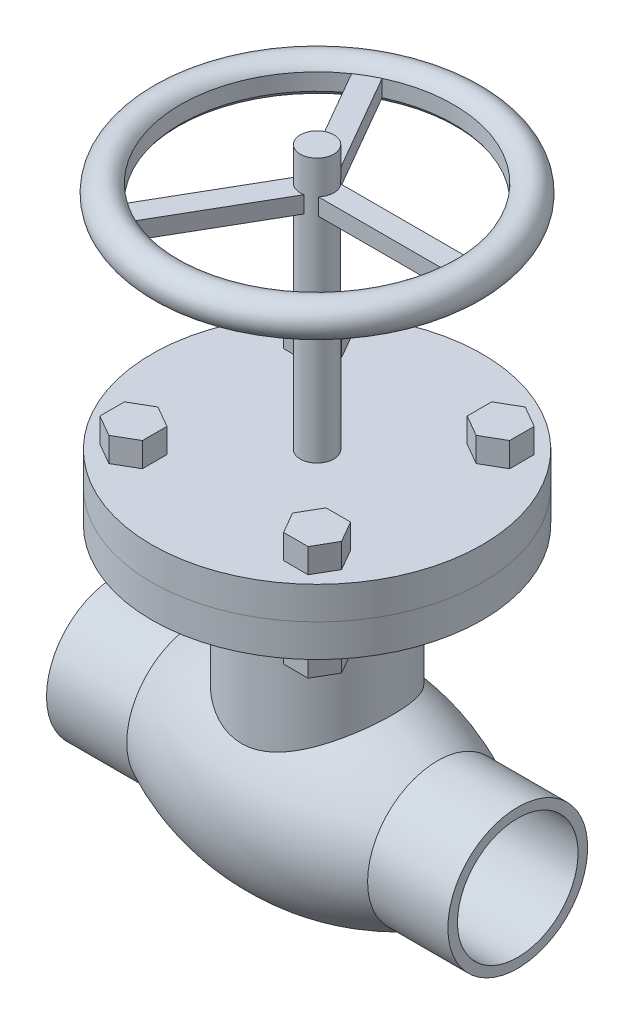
ISO-10303-21;
HEADER;
FILE_DESCRIPTION(('STEP AP214'),'2;1');
FILE_NAME('part.step','',(''),(''),'','','');
FILE_SCHEMA(('AUTOMOTIVE_DESIGN { 1 0 10303 214 1 1 1 1 }'));
ENDSEC;
DATA;
#1=APPLICATION_CONTEXT('core data for automotive mechanical design processes');
#2=APPLICATION_PROTOCOL_DEFINITION('international standard','automotive_design',2000,#1);
#3=PRODUCT_CONTEXT('',#1,'mechanical');
#4=PRODUCT('Part','Part','',(#3));
#5=PRODUCT_RELATED_PRODUCT_CATEGORY('part','',(#4));
#6=PRODUCT_DEFINITION_FORMATION('','',#4);
#7=PRODUCT_DEFINITION_CONTEXT('part definition',#1,'design');
#8=PRODUCT_DEFINITION('design','',#6,#7);
#9=PRODUCT_DEFINITION_SHAPE('','',#8);
#10=(LENGTH_UNIT() NAMED_UNIT(*) SI_UNIT(.MILLI.,.METRE.));
#11=(NAMED_UNIT(*) PLANE_ANGLE_UNIT() SI_UNIT($,.RADIAN.));
#12=(NAMED_UNIT(*) SI_UNIT($,.STERADIAN.) SOLID_ANGLE_UNIT());
#13=UNCERTAINTY_MEASURE_WITH_UNIT(LENGTH_MEASURE(1.E-05),#10,'distance_accuracy_value','');
#14=(GEOMETRIC_REPRESENTATION_CONTEXT(3) GLOBAL_UNCERTAINTY_ASSIGNED_CONTEXT((#13)) GLOBAL_UNIT_ASSIGNED_CONTEXT((#10,
#11,#12)) REPRESENTATION_CONTEXT('',''));
#15=CARTESIAN_POINT('',(0.,0.,0.));
#16=DIRECTION('',(0.,0.,1.));
#17=DIRECTION('',(1.,0.,0.));
#18=AXIS2_PLACEMENT_3D('',#15,#16,#17);
#19=CARTESIAN_POINT('',(0.,132.715,0.));
#20=DIRECTION('',(0.,-1.,0.));
#21=DIRECTION('',(0.,0.,-1.));
#22=AXIS2_PLACEMENT_3D('',#19,#20,#21);
#23=CYLINDRICAL_SURFACE('',#22,88.9);
#24=CARTESIAN_POINT('',(0.,150.241,0.));
#25=DIRECTION('',(0.,1.,0.));
#26=DIRECTION('',(0.,0.,1.));
#27=AXIS2_PLACEMENT_3D('',#24,#25,#26);
#28=CIRCLE('',#27,88.9);
#29=CARTESIAN_POINT('',(0.,150.241,88.9));
#30=VERTEX_POINT('',#29);
#31=EDGE_CURVE('E827',#30,#30,#28,.T.);
#32=ORIENTED_EDGE('',*,*,#31,.F.);
#33=EDGE_LOOP('',(#32));
#34=FACE_BOUND('',#33,.T.);
#35=CARTESIAN_POINT('',(0.,132.715,0.));
#36=DIRECTION('',(0.,-1.,0.));
#37=DIRECTION('',(0.,0.,-1.));
#38=AXIS2_PLACEMENT_3D('',#35,#36,#37);
#39=CIRCLE('',#38,88.9);
#40=CARTESIAN_POINT('',(88.9,132.715,0.));
#41=VERTEX_POINT('',#40);
#42=CARTESIAN_POINT('',(-88.9,132.715,0.));
#43=VERTEX_POINT('',#42);
#44=EDGE_CURVE('E11',#41,#43,#39,.T.);
#45=ORIENTED_EDGE('',*,*,#44,.F.);
#46=EDGE_CURVE('E40',#43,#41,#39,.T.);
#47=ORIENTED_EDGE('',*,*,#46,.F.);
#48=EDGE_LOOP('',(#45,#47));
#49=FACE_BOUND('',#48,.T.);
#50=ADVANCED_FACE('F36',(#34,#49),#23,.T.);
#51=CARTESIAN_POINT('',(-107.95,37.592,0.));
#52=DIRECTION('',(1.,0.,0.));
#53=DIRECTION('',(0.,0.,-1.));
#54=AXIS2_PLACEMENT_3D('',#51,#52,#53);
#55=PLANE('',#54);
#56=CARTESIAN_POINT('',(-107.95,0.,0.));
#57=DIRECTION('',(-1.,0.,0.));
#58=DIRECTION('',(0.,0.,1.));
#59=AXIS2_PLACEMENT_3D('',#56,#57,#58);
#60=CIRCLE('',#59,37.592);
#61=CARTESIAN_POINT('',(-107.95,0.,37.592));
#62=VERTEX_POINT('',#61);
#63=EDGE_CURVE('E846',#62,#62,#60,.T.);
#64=ORIENTED_EDGE('',*,*,#63,.T.);
#65=EDGE_LOOP('',(#64));
#66=FACE_BOUND('',#65,.T.);
#67=CARTESIAN_POINT('',(-107.95,0.,0.));
#68=DIRECTION('',(-1.,0.,0.));
#69=DIRECTION('',(0.,0.,1.));
#70=AXIS2_PLACEMENT_3D('',#67,#68,#69);
#71=CIRCLE('',#70,32.4358);
#72=CARTESIAN_POINT('',(-107.95,0.,32.4358));
#73=VERTEX_POINT('',#72);
#74=EDGE_CURVE('E733',#73,#73,#71,.T.);
#75=ORIENTED_EDGE('',*,*,#74,.F.);
#76=EDGE_LOOP('',(#75));
#77=FACE_BOUND('',#76,.T.);
#78=ADVANCED_FACE('F38',(#66,#77),#55,.F.);
#79=CARTESIAN_POINT('',(107.95,37.592,0.));
#80=DIRECTION('',(-1.,0.,0.));
#81=DIRECTION('',(0.,0.,1.));
#82=AXIS2_PLACEMENT_3D('',#79,#80,#81);
#83=PLANE('',#82);
#84=CARTESIAN_POINT('',(107.95,0.,0.));
#85=DIRECTION('',(-1.,0.,0.));
#86=DIRECTION('',(0.,0.,1.));
#87=AXIS2_PLACEMENT_3D('',#84,#85,#86);
#88=CIRCLE('',#87,37.592);
#89=CARTESIAN_POINT('',(107.95,0.,37.592));
#90=VERTEX_POINT('',#89);
#91=EDGE_CURVE('E837',#90,#90,#88,.T.);
#92=ORIENTED_EDGE('',*,*,#91,.F.);
#93=EDGE_LOOP('',(#92));
#94=FACE_BOUND('',#93,.T.);
#95=CARTESIAN_POINT('',(107.95,0.,0.));
#96=DIRECTION('',(-1.,0.,0.));
#97=DIRECTION('',(0.,0.,1.));
#98=AXIS2_PLACEMENT_3D('',#95,#96,#97);
#99=CIRCLE('',#98,32.4358);
#100=CARTESIAN_POINT('',(107.95,0.,32.4358));
#101=VERTEX_POINT('',#100);
#102=EDGE_CURVE('E732',#101,#101,#99,.T.);
#103=ORIENTED_EDGE('',*,*,#102,.T.);
#104=EDGE_LOOP('',(#103));
#105=FACE_BOUND('',#104,.T.);
#106=ADVANCED_FACE('F871',(#94,#105),#83,.F.);
#107=CARTESIAN_POINT('',(-73.3440489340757,265.2395,0.));
#108=DIRECTION('',(0.,1.,0.));
#109=DIRECTION('',(0.,0.,1.));
#110=AXIS2_PLACEMENT_3D('',#107,#108,#109);
#111=PLANE('',#110);
#112=CARTESIAN_POINT('',(0.,265.2395,0.));
#113=DIRECTION('',(0.,-1.,0.));
#114=DIRECTION('',(0.,0.,-1.));
#115=AXIS2_PLACEMENT_3D('',#112,#113,#114);
#116=CIRCLE('',#115,73.3440489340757);
#117=CARTESIAN_POINT('',(-31.3426761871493,265.2395,66.3097742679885));
#118=VERTEX_POINT('',#117);
#119=CARTESIAN_POINT('',(-41.754610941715,265.2395,60.2984409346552));
#120=VERTEX_POINT('',#119);
#121=EDGE_CURVE('E823',#118,#120,#116,.T.);
#122=ORIENTED_EDGE('',*,*,#121,.T.);
#123=DIRECTION('',(-0.5,0.,0.866025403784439));
#124=VECTOR('',#123,1.);
#125=CARTESIAN_POINT('',(-41.754610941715,265.2395,60.2984409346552));
#126=LINE('',#125,#124);
#127=CARTESIAN_POINT('',(-8.56640486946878,265.2395,2.81478180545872));
#128=VERTEX_POINT('',#127);
#129=EDGE_CURVE('E741',#128,#120,#126,.T.);
#130=ORIENTED_EDGE('',*,*,#129,.F.);
#131=CARTESIAN_POINT('',(0.,265.2395,0.));
#132=DIRECTION('',(0.,1.,0.));
#133=DIRECTION('',(0.,0.,1.));
#134=AXIS2_PLACEMENT_3D('',#131,#132,#133);
#135=CIRCLE('',#134,9.017);
#136=CARTESIAN_POINT('',(1.84552988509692,265.2395,8.82611513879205));
#137=VERTEX_POINT('',#136);
#138=EDGE_CURVE('E953',#137,#128,#135,.F.);
#139=ORIENTED_EDGE('',*,*,#138,.F.);
#140=DIRECTION('',(0.5,0.,-0.866025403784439));
#141=VECTOR('',#140,1.);
#142=CARTESIAN_POINT('',(-31.3426761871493,265.2395,66.3097742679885));
#143=LINE('',#142,#141);
#144=EDGE_CURVE('E768',#118,#137,#143,.T.);
#145=ORIENTED_EDGE('',*,*,#144,.F.);
#146=EDGE_LOOP('',(#122,#130,#139,#145));
#147=FACE_BOUND('',#146,.T.);
#148=ADVANCED_FACE('F873',(#147),#111,.F.);
#149=CARTESIAN_POINT('',(-73.3440489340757,274.2565,0.));
#150=DIRECTION('',(0.,-1.,0.));
#151=DIRECTION('',(0.,0.,-1.));
#152=AXIS2_PLACEMENT_3D('',#149,#150,#151);
#153=PLANE('',#152);
#154=CARTESIAN_POINT('',(0.,274.2565,0.));
#155=DIRECTION('',(0.,-1.,0.));
#156=DIRECTION('',(0.,0.,-1.));
#157=AXIS2_PLACEMENT_3D('',#154,#155,#156);
#158=CIRCLE('',#157,9.017);
#159=CARTESIAN_POINT('',(-8.56640486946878,274.2565,2.81478180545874));
#160=VERTEX_POINT('',#159);
#161=CARTESIAN_POINT('',(1.84552988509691,274.2565,8.82611513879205));
#162=VERTEX_POINT('',#161);
#163=EDGE_CURVE('E943',#160,#162,#158,.F.);
#164=ORIENTED_EDGE('',*,*,#163,.F.);
#165=DIRECTION('',(0.5,0.,-0.866025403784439));
#166=VECTOR('',#165,1.);
#167=CARTESIAN_POINT('',(-41.754610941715,274.2565,60.2984409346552));
#168=LINE('',#167,#166);
#169=CARTESIAN_POINT('',(-41.754610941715,274.2565,60.2984409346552));
#170=VERTEX_POINT('',#169);
#171=EDGE_CURVE('E750',#170,#160,#168,.T.);
#172=ORIENTED_EDGE('',*,*,#171,.F.);
#173=CARTESIAN_POINT('',(0.,274.2565,0.));
#174=DIRECTION('',(0.,-1.,0.));
#175=DIRECTION('',(0.,0.,-1.));
#176=AXIS2_PLACEMENT_3D('',#173,#174,#175);
#177=CIRCLE('',#176,73.3440489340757);
#178=CARTESIAN_POINT('',(-31.3426761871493,274.2565,66.3097742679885));
#179=VERTEX_POINT('',#178);
#180=EDGE_CURVE('E818',#179,#170,#177,.T.);
#181=ORIENTED_EDGE('',*,*,#180,.F.);
#182=DIRECTION('',(-0.5,0.,0.866025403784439));
#183=VECTOR('',#182,1.);
#184=CARTESIAN_POINT('',(-31.3426761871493,274.2565,66.3097742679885));
#185=LINE('',#184,#183);
#186=EDGE_CURVE('E762',#162,#179,#185,.T.);
#187=ORIENTED_EDGE('',*,*,#186,.F.);
#188=EDGE_LOOP('',(#164,#172,#181,#187));
#189=FACE_BOUND('',#188,.T.);
#190=ADVANCED_FACE('F919',(#189),#153,.F.);
#191=CARTESIAN_POINT('',(73.0972871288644,265.2395,-6.01133333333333));
#192=VERTEX_POINT('',#191);
#193=CARTESIAN_POINT('',(73.0972871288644,265.2395,6.01133333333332));
#194=VERTEX_POINT('',#193);
#195=EDGE_CURVE('E819',#192,#194,#116,.T.);
#196=ORIENTED_EDGE('',*,*,#195,.T.);
#197=DIRECTION('',(1.,0.,0.));
#198=VECTOR('',#197,1.);
#199=CARTESIAN_POINT('',(73.0972871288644,265.2395,6.01133333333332));
#200=LINE('',#199,#198);
#201=CARTESIAN_POINT('',(6.72087498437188,265.2395,6.01133333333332));
#202=VERTEX_POINT('',#201);
#203=EDGE_CURVE('E765',#202,#194,#200,.T.);
#204=ORIENTED_EDGE('',*,*,#203,.F.);
#205=CARTESIAN_POINT('',(6.72087498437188,265.2395,-6.01133333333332));
#206=VERTEX_POINT('',#205);
#207=EDGE_CURVE('E828',#206,#202,#135,.F.);
#208=ORIENTED_EDGE('',*,*,#207,.F.);
#209=DIRECTION('',(-1.,0.,0.));
#210=VECTOR('',#209,1.);
#211=CARTESIAN_POINT('',(73.0972871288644,265.2395,-6.01133333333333));
#212=LINE('',#211,#210);
#213=EDGE_CURVE('E788',#192,#206,#212,.T.);
#214=ORIENTED_EDGE('',*,*,#213,.F.);
#215=EDGE_LOOP('',(#196,#204,#208,#214));
#216=FACE_BOUND('',#215,.T.);
#217=ADVANCED_FACE('F915',(#216),#111,.F.);
#218=CARTESIAN_POINT('',(6.72087498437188,274.2565,6.01133333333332));
#219=VERTEX_POINT('',#218);
#220=CARTESIAN_POINT('',(6.72087498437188,274.2565,-6.01133333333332));
#221=VERTEX_POINT('',#220);
#222=EDGE_CURVE('E822',#219,#221,#158,.F.);
#223=ORIENTED_EDGE('',*,*,#222,.F.);
#224=DIRECTION('',(-1.,0.,0.));
#225=VECTOR('',#224,1.);
#226=CARTESIAN_POINT('',(73.0972871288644,274.2565,6.01133333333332));
#227=LINE('',#226,#225);
#228=CARTESIAN_POINT('',(73.0972871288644,274.2565,6.01133333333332));
#229=VERTEX_POINT('',#228);
#230=EDGE_CURVE('E774',#229,#219,#227,.T.);
#231=ORIENTED_EDGE('',*,*,#230,.F.);
#232=CARTESIAN_POINT('',(73.0972871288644,274.2565,-6.01133333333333));
#233=VERTEX_POINT('',#232);
#234=EDGE_CURVE('E814',#233,#229,#177,.T.);
#235=ORIENTED_EDGE('',*,*,#234,.F.);
#236=DIRECTION('',(1.,0.,0.));
#237=VECTOR('',#236,1.);
#238=CARTESIAN_POINT('',(73.0972871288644,274.2565,-6.01133333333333));
#239=LINE('',#238,#237);
#240=EDGE_CURVE('E798',#221,#233,#239,.T.);
#241=ORIENTED_EDGE('',*,*,#240,.F.);
#242=EDGE_LOOP('',(#223,#231,#235,#241));
#243=FACE_BOUND('',#242,.T.);
#244=ADVANCED_FACE('F910',(#243),#153,.F.);
#245=CARTESIAN_POINT('',(0.,0.,0.));
#246=DIRECTION('',(-1.,0.,0.));
#247=DIRECTION('',(0.,0.,1.));
#248=AXIS2_PLACEMENT_3D('',#245,#246,#247);
#249=DEGENERATE_TOROIDAL_SURFACE('',#248,94.3857993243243,147.014599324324,.F.);
#250=CARTESIAN_POINT('',(64.77,0.,0.));
#251=DIRECTION('',(-1.,0.,0.));
#252=DIRECTION('',(0.,0.,1.));
#253=AXIS2_PLACEMENT_3D('',#250,#251,#252);
#254=CIRCLE('',#253,37.592);
#255=CARTESIAN_POINT('',(64.77,0.,37.592));
#256=VERTEX_POINT('',#255);
#257=EDGE_CURVE('E840',#256,#256,#254,.T.);
#258=ORIENTED_EDGE('',*,*,#257,.T.);
#259=EDGE_LOOP('',(#258));
#260=FACE_BOUND('',#259,.T.);
#261=CARTESIAN_POINT('',(-64.77,0.,0.));
#262=DIRECTION('',(-1.,0.,0.));
#263=DIRECTION('',(0.,0.,1.));
#264=AXIS2_PLACEMENT_3D('',#261,#262,#263);
#265=CIRCLE('',#264,37.592);
#266=CARTESIAN_POINT('',(-64.77,0.,37.592));
#267=VERTEX_POINT('',#266);
#268=EDGE_CURVE('E843',#267,#267,#265,.T.);
#269=ORIENTED_EDGE('',*,*,#268,.F.);
#270=EDGE_LOOP('',(#269));
#271=FACE_BOUND('',#270,.T.);
#272=CARTESIAN_POINT('',(-17.9291570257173,36.4377093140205,-36.4387375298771));
#273=CARTESIAN_POINT('',(-19.000407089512,36.7786645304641,-35.9116422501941));
#274=CARTESIAN_POINT('',(-20.0443422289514,37.1371444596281,-35.3392985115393));
#275=CARTESIAN_POINT('',(-22.0730238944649,37.8760230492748,-34.1090458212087));
#276=CARTESIAN_POINT('',(-23.0577238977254,38.2564384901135,-33.4510708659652));
#277=CARTESIAN_POINT('',(-24.9667162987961,39.0283556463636,-32.0515872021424));
#278=CARTESIAN_POINT('',(-25.8908018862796,39.4198893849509,-31.3098138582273));
#279=CARTESIAN_POINT('',(-27.6707849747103,40.2017219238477,-29.7483671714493));
#280=CARTESIAN_POINT('',(-28.5266967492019,40.5920209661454,-28.9287102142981));
#281=CARTESIAN_POINT('',(-30.166089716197,41.361289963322,-27.2148724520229));
#282=CARTESIAN_POINT('',(-30.949568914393,41.7402596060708,-26.3206895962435));
#283=CARTESIAN_POINT('',(-32.43887907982,42.4772704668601,-24.4616864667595));
#284=CARTESIAN_POINT('',(-33.1447058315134,42.8353105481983,-23.4968623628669));
#285=CARTESIAN_POINT('',(-34.4720588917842,43.5209489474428,-21.5022286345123));
#286=CARTESIAN_POINT('',(-35.0936917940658,43.8485855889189,-20.4725036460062));
#287=CARTESIAN_POINT('',(-35.9586852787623,44.3110179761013,-18.8831528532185));
#288=CARTESIAN_POINT('',(-36.235805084,44.4603423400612,-18.3458367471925));
#289=CARTESIAN_POINT('',(-36.7667853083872,44.7483279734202,-17.2570683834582));
#290=CARTESIAN_POINT('',(-37.0206487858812,44.8869906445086,-16.7056179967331));
#291=CARTESIAN_POINT('',(-37.4934955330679,45.1467392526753,-15.6144700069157));
#292=CARTESIAN_POINT('',(-37.7135306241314,45.2683337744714,-15.0753486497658));
#293=CARTESIAN_POINT('',(-38.1309157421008,45.5000858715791,-13.986052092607));
#294=CARTESIAN_POINT('',(-38.3282687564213,45.610244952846,-13.4358783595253));
#295=CARTESIAN_POINT('',(-38.6996696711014,45.8184033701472,-12.3253669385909));
#296=CARTESIAN_POINT('',(-38.8737144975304,45.9164011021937,-11.765027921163));
#297=CARTESIAN_POINT('',(-39.1978143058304,46.0995189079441,-10.6354508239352));
#298=CARTESIAN_POINT('',(-39.3478723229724,46.184640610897,-10.0662138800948));
#299=CARTESIAN_POINT('',(-39.6233652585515,46.3413590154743,-8.92032589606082));
#300=CARTESIAN_POINT('',(-39.7488146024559,46.4129636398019,-8.34367941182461));
#301=CARTESIAN_POINT('',(-39.9746788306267,46.5421712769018,-7.1840265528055));
#302=CARTESIAN_POINT('',(-40.0750969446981,46.599776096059,-6.60102100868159));
#303=CARTESIAN_POINT('',(-40.250492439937,46.7005567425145,-5.42997012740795));
#304=CARTESIAN_POINT('',(-40.3254710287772,46.7437332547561,-4.8419250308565));
#305=CARTESIAN_POINT('',(-40.4496699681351,46.8153311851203,-3.66228890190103));
#306=CARTESIAN_POINT('',(-40.4988912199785,46.8437531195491,-3.07069799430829));
#307=CARTESIAN_POINT('',(-40.5981655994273,46.9010994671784,-1.44648677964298));
#308=CARTESIAN_POINT('',(-40.621865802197,46.9148232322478,-0.411550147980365));
#309=CARTESIAN_POINT('',(-40.5901729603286,46.896497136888,1.65646687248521));
#310=CARTESIAN_POINT('',(-40.5347879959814,46.8644519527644,2.68954744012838));
#311=CARTESIAN_POINT('',(-40.3457277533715,46.7553811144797,4.745990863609));
#312=CARTESIAN_POINT('',(-40.212062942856,46.6783614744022,5.76935500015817));
#313=CARTESIAN_POINT('',(-39.8681960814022,46.481132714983,7.79888631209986));
#314=CARTESIAN_POINT('',(-39.6579930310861,46.3609230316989,8.80505326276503));
#315=CARTESIAN_POINT('',(-39.172560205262,46.0850882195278,10.7574180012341));
#316=CARTESIAN_POINT('',(-38.8999428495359,45.9308933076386,11.7044708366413));
#317=CARTESIAN_POINT('',(-38.2888930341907,45.587989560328,13.5705894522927));
#318=CARTESIAN_POINT('',(-37.9504630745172,45.3992820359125,14.4896562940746));
#319=CARTESIAN_POINT('',(-37.2109677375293,44.9909350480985,16.2951512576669));
#320=CARTESIAN_POINT('',(-36.8098979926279,44.7712934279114,17.181577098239));
#321=CARTESIAN_POINT('',(-35.9484866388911,44.3050655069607,18.9177653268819));
#322=CARTESIAN_POINT('',(-35.488141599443,44.0584776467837,19.7675255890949));
#323=CARTESIAN_POINT('',(-34.4691607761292,43.5202456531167,21.4990210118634));
#324=CARTESIAN_POINT('',(-33.9054634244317,43.2265486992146,22.3771400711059));
#325=CARTESIAN_POINT('',(-32.7161164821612,42.6181320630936,24.0826290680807));
#326=CARTESIAN_POINT('',(-32.0904639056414,42.3034113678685,24.9099965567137));
#327=CARTESIAN_POINT('',(-30.7804069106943,41.6586958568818,26.5117756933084));
#328=CARTESIAN_POINT('',(-30.0959512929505,41.3286878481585,27.2861401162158));
#329=CARTESIAN_POINT('',(-28.6721537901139,40.6599815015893,28.7785982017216));
#330=CARTESIAN_POINT('',(-27.9328093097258,40.3212827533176,29.4966892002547));
#331=CARTESIAN_POINT('',(-26.304454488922,39.5984592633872,30.9622351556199));
#332=CARTESIAN_POINT('',(-25.4083872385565,39.2140555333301,31.7017348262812));
#333=CARTESIAN_POINT('',(-23.5540374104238,38.452900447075,33.1027868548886));
#334=CARTESIAN_POINT('',(-22.5957453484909,38.0761502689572,33.7643272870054));
#335=CARTESIAN_POINT('',(-20.6207856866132,37.3416077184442,35.0054080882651));
#336=CARTESIAN_POINT('',(-19.6041399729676,36.9838083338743,35.5849789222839));
#337=CARTESIAN_POINT('',(-18.0386618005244,36.4706028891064,36.3893824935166));
#338=CARTESIAN_POINT('',(-17.51011901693,36.3034598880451,36.6466772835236));
#339=CARTESIAN_POINT('',(-16.4398076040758,35.9785357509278,37.1391447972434));
#340=CARTESIAN_POINT('',(-15.8980356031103,35.8207570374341,37.3743118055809));
#341=CARTESIAN_POINT('',(-14.468404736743,35.4235911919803,37.957979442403));
#342=CARTESIAN_POINT('',(-13.5705976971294,35.1929814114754,38.2883442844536));
#343=CARTESIAN_POINT('',(-11.7462465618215,34.7675685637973,38.8867971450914));
#344=CARTESIAN_POINT('',(-10.8197087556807,34.5727577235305,39.154898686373));
#345=CARTESIAN_POINT('',(-9.4124492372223,34.3126363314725,39.5079203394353));
#346=CARTESIAN_POINT('',(-8.94070223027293,34.2313120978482,39.6173618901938));
#347=CARTESIAN_POINT('',(-7.99193423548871,34.0800735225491,39.8195997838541));
#348=CARTESIAN_POINT('',(-7.51491417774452,34.010157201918,39.9123990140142));
#349=CARTESIAN_POINT('',(-6.07687171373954,33.8186103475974,40.1653415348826));
#350=CARTESIAN_POINT('',(-5.10872972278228,33.7151561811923,40.3000641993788));
#351=CARTESIAN_POINT('',(-3.15570307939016,33.5609630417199,40.4999620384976));
#352=CARTESIAN_POINT('',(-2.17075523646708,33.5105206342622,40.564746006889));
#353=CARTESIAN_POINT('',(-0.197431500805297,33.4657287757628,40.6223019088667));
#354=CARTESIAN_POINT('',(0.790944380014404,33.4713791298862,40.6150740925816));
#355=CARTESIAN_POINT('',(2.76298089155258,33.5385194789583,40.5287160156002));
#356=CARTESIAN_POINT('',(3.74663954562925,33.6000311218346,40.4495578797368));
#357=CARTESIAN_POINT('',(5.7008521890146,33.7760428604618,40.2206965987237));
#358=CARTESIAN_POINT('',(6.67140625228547,33.8905426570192,40.0709938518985));
#359=CARTESIAN_POINT('',(8.51846742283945,34.1568441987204,39.7175918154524));
#360=CARTESIAN_POINT('',(9.39646490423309,34.3050979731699,39.518933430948));
#361=CARTESIAN_POINT('',(11.1312903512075,34.6375324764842,39.065774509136));
#362=CARTESIAN_POINT('',(11.9881099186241,34.8217272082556,38.8112522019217));
#363=CARTESIAN_POINT('',(13.6769140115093,35.2205312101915,38.248799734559));
#364=CARTESIAN_POINT('',(14.5088928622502,35.4351473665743,37.9408574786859));
#365=CARTESIAN_POINT('',(16.1449169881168,35.8890435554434,37.2740944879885));
#366=CARTESIAN_POINT('',(16.9489692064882,36.1283173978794,36.9152865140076));
#367=CARTESIAN_POINT('',(18.6479715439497,36.6641161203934,36.0903354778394));
#368=CARTESIAN_POINT('',(19.5380337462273,36.9638019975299,35.6161690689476));
#369=CARTESIAN_POINT('',(21.2759961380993,37.5806856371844,34.6060497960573));
#370=CARTESIAN_POINT('',(22.1238933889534,37.8978846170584,34.0700926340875));
#371=CARTESIAN_POINT('',(23.7757690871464,38.5425920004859,32.938608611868));
#372=CARTESIAN_POINT('',(24.5797166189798,38.8701074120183,32.3430406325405));
#373=CARTESIAN_POINT('',(26.1407499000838,39.5283620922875,31.0949553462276));
#374=CARTESIAN_POINT('',(26.8978324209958,39.8591015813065,30.4424341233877));
#375=CARTESIAN_POINT('',(28.4920881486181,40.5755694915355,28.962387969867));
#376=CARTESIAN_POINT('',(29.3197803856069,40.9606895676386,28.124311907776));
#377=CARTESIAN_POINT('',(30.9021964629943,41.7167243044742,26.3757666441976));
#378=CARTESIAN_POINT('',(31.6569119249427,42.0876373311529,25.465289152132));
#379=CARTESIAN_POINT('',(33.0881111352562,42.8060438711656,23.5757859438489));
#380=CARTESIAN_POINT('',(33.7645839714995,43.1535341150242,22.5967506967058));
#381=CARTESIAN_POINT('',(35.0331668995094,43.8162050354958,20.57516763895));
#382=CARTESIAN_POINT('',(35.6252826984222,44.1313878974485,19.5326241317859));
#383=CARTESIAN_POINT('',(36.7089995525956,44.715848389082,17.4091838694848));
#384=CARTESIAN_POINT('',(37.2022288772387,44.9858549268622,16.3293256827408));
#385=CARTESIAN_POINT('',(37.8718265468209,45.3560175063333,14.6736499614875));
#386=CARTESIAN_POINT('',(38.0833501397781,45.4736153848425,14.1156718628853));
#387=CARTESIAN_POINT('',(38.4822784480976,45.6963915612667,12.9887480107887));
#388=CARTESIAN_POINT('',(38.6696862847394,45.8015714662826,12.4198036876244));
#389=CARTESIAN_POINT('',(39.0195331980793,45.9986581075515,11.2726050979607));
#390=CARTESIAN_POINT('',(39.1819946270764,46.0905767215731,10.6943596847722));
#391=CARTESIAN_POINT('',(39.4814980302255,46.2605598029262,9.52938825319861));
#392=CARTESIAN_POINT('',(39.618543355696,46.3386260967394,8.94266336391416));
#393=CARTESIAN_POINT('',(39.8666619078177,46.4803140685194,7.76204261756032));
#394=CARTESIAN_POINT('',(39.9777367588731,46.5439366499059,7.16814721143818));
#395=CARTESIAN_POINT('',(40.1734402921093,46.6562440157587,5.97467877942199));
#396=CARTESIAN_POINT('',(40.2580699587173,46.7049293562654,5.37510596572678));
#397=CARTESIAN_POINT('',(40.4530305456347,46.8172191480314,3.72776697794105));
#398=CARTESIAN_POINT('',(40.5362877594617,46.8653474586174,2.6755598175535));
#399=CARTESIAN_POINT('',(40.6205416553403,46.9140523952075,0.566985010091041));
#400=CARTESIAN_POINT('',(40.6215465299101,46.9146337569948,-0.489382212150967));
#401=CARTESIAN_POINT('',(40.5413434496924,46.8682695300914,-2.59774395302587));
#402=CARTESIAN_POINT('',(40.4601524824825,46.8213337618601,-3.64973933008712));
#403=CARTESIAN_POINT('',(40.2167106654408,46.6810964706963,-5.74115042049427));
#404=CARTESIAN_POINT('',(40.0544603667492,46.5877952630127,-6.78056621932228));
#405=CARTESIAN_POINT('',(39.6629948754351,46.3638851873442,-8.77823129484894));
#406=CARTESIAN_POINT('',(39.4382895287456,46.235798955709,-9.73765401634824));
#407=CARTESIAN_POINT('',(38.9215543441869,45.9431995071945,-11.6324167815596));
#408=CARTESIAN_POINT('',(38.6295281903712,45.7786882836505,-12.5677581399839));
#409=CARTESIAN_POINT('',(37.9810920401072,45.4164481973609,-14.4092306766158));
#410=CARTESIAN_POINT('',(37.6246784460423,45.2187174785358,-15.3153602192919));
#411=CARTESIAN_POINT('',(36.8507043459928,44.793725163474,-17.0939349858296));
#412=CARTESIAN_POINT('',(36.433140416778,44.5664619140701,-17.9663783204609));
#413=CARTESIAN_POINT('',(35.5090894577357,44.069710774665,-19.7332916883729));
#414=CARTESIAN_POINT('',(34.9984349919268,43.7983845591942,-20.6250648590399));
#415=CARTESIAN_POINT('',(33.9149802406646,43.2318069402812,-22.3619827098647));
#416=CARTESIAN_POINT('',(33.3421776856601,42.9365546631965,-23.2071256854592));
#417=CARTESIAN_POINT('',(32.1378014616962,42.3274400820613,-24.8482318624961));
#418=CARTESIAN_POINT('',(31.5061890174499,42.013565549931,-25.6441620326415));
#419=CARTESIAN_POINT('',(30.1879657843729,41.3731535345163,-27.1836367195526));
#420=CARTESIAN_POINT('',(29.5013522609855,41.0466154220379,-27.9271786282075));
#421=CARTESIAN_POINT('',(27.9840129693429,40.3442363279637,-29.4522156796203));
#422=CARTESIAN_POINT('',(27.1461324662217,39.9674795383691,-30.2261880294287));
#423=CARTESIAN_POINT('',(25.408043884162,39.214730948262,-31.7012179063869));
#424=CARTESIAN_POINT('',(24.5078274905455,38.8387392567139,-32.4022656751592));
#425=CARTESIAN_POINT('',(22.6483799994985,38.0974346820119,-33.7281898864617));
#426=CARTESIAN_POINT('',(21.6891430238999,37.7321228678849,-34.3530587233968));
#427=CARTESIAN_POINT('',(20.2091594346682,37.200557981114,-35.2300292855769));
#428=CARTESIAN_POINT('',(19.7089957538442,37.0261095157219,-35.5122882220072));
#429=CARTESIAN_POINT('',(18.6951691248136,36.6840514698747,-36.0563164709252));
#430=CARTESIAN_POINT('',(18.1815027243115,36.5164436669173,-36.3180804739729));
#431=CARTESIAN_POINT('',(16.7761935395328,36.0749164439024,-36.9967796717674));
#432=CARTESIAN_POINT('',(15.8722518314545,35.8089278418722,-37.3937063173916));
#433=CARTESIAN_POINT('',(14.0302846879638,35.3091144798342,-38.1230690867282));
#434=CARTESIAN_POINT('',(13.0922658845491,35.0752835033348,-38.4555176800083));
#435=CARTESIAN_POINT('',(11.1871255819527,34.6479280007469,-39.0522639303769));
#436=CARTESIAN_POINT('',(10.2200442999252,34.4543504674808,-39.3166513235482));
#437=CARTESIAN_POINT('',(8.2609385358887,34.1146872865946,-39.7744248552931));
#438=CARTESIAN_POINT('',(7.26891445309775,33.9686008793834,-39.9678121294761));
#439=CARTESIAN_POINT('',(5.25932607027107,33.7294929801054,-40.281725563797));
#440=CARTESIAN_POINT('',(4.24162689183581,33.6368732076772,-40.401700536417));
#441=CARTESIAN_POINT('',(2.1963632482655,33.5109533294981,-40.564325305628));
#442=CARTESIAN_POINT('',(1.16879886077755,33.4776527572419,-40.6069757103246));
#443=CARTESIAN_POINT('',(-0.887179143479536,33.4720912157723,-40.6141160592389));
#444=CARTESIAN_POINT('',(-1.91559293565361,33.4998550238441,-40.5785742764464));
#445=CARTESIAN_POINT('',(-3.96333180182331,33.6150370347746,-40.4299641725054));
#446=CARTESIAN_POINT('',(-4.9826575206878,33.7024509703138,-40.3169013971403));
#447=CARTESIAN_POINT('',(-6.88908550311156,33.9195189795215,-40.0324610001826));
#448=CARTESIAN_POINT('',(-7.77808901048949,34.0432684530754,-39.8691373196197));
#449=CARTESIAN_POINT('',(-9.53723457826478,34.3297828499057,-39.4852867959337));
#450=CARTESIAN_POINT('',(-10.4073761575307,34.4925487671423,-39.2647584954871));
#451=CARTESIAN_POINT('',(-12.123557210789,34.85160961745,-38.7692219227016));
#452=CARTESIAN_POINT('',(-12.9696258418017,35.0478617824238,-38.4942830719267));
#453=CARTESIAN_POINT('',(-14.6355024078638,35.468408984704,-37.8922468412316));
#454=CARTESIAN_POINT('',(-15.4553195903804,35.6926940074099,-37.565168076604));
#455=CARTESIAN_POINT('',(-16.5424037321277,36.0105177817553,-37.090155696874));
#456=CARTESIAN_POINT('',(-16.8222909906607,36.09422961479,-36.9640474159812));
#457=CARTESIAN_POINT('',(-17.3784349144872,36.2641477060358,-36.7058609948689));
#458=CARTESIAN_POINT('',(-17.6546924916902,36.3503533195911,-36.5737843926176));
#459=CARTESIAN_POINT('',(-17.9291570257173,36.4377093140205,-36.4387375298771));
#460=B_SPLINE_CURVE_WITH_KNOTS('',3,(#272,#273,#274,#275,#276,#277,#278,#279,#280,#281,#282,
#283,#284,#285,#286,#287,#288,#289,#290,#291,#292,#293,#294,#295,#296,#297,#298,#299,#300,#301,
#302,#303,#304,#305,#306,#307,#308,#309,#310,#311,#312,#313,#314,#315,#316,#317,#318,#319,#320,
#321,#322,#323,#324,#325,#326,#327,#328,#329,#330,#331,#332,#333,#334,#335,#336,#337,#338,#339,
#340,#341,#342,#343,#344,#345,#346,#347,#348,#349,#350,#351,#352,#353,#354,#355,#356,#357,#358,
#359,#360,#361,#362,#363,#364,#365,#366,#367,#368,#369,#370,#371,#372,#373,#374,#375,#376,#377,
#378,#379,#380,#381,#382,#383,#384,#385,#386,#387,#388,#389,#390,#391,#392,#393,#394,#395,#396,
#397,#398,#399,#400,#401,#402,#403,#404,#405,#406,#407,#408,#409,#410,#411,#412,#413,#414,#415,
#416,#417,#418,#419,#420,#421,#422,#423,#424,#425,#426,#427,#428,#429,#430,#431,#432,#433,#434,
#435,#436,#437,#438,#439,#440,#441,#442,#443,#444,#445,#446,#447,#448,#449,#450,#451,#452,#453,
#454,#455,#456,#457,#458,#459),.UNSPECIFIED.,.T.,.F.,(4,2,2,2,2,2,2,2,2,2,2,2,2,2,2,2,2,2,2,2,2,
2,2,2,2,2,2,2,2,2,2,2,2,2,2,2,2,2,2,2,2,2,2,2,2,2,2,2,2,2,2,2,2,2,2,2,2,2,2,2,2,2,2,2,2,2,2,2,2,
2,2,2,2,2,2,2,2,2,2,2,2,2,2,2,2,2,2,2,2,2,2,2,2,4),(0.,3.72459076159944,7.4520695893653,
11.191667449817,14.9304802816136,18.6693960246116,22.4085146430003,26.1428541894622,
28.0105042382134,29.8779083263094,31.6618519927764,33.4455604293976,35.2295038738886,
37.0132214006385,38.7958901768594,40.5783288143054,42.3606828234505,44.1429744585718,
47.2445319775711,50.3457726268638,53.4465986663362,56.5474651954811,59.5367378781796,
62.5258970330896,65.5152647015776,68.5048054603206,71.7535593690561,75.0024699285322,
78.2542385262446,81.5061609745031,85.1732471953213,88.8408936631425,92.5071734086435,
94.3400803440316,96.1734594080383,99.1226985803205,102.071296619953,103.544074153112,
105.016595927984,107.961209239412,110.922209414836,113.883199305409,116.845337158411,
119.807458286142,122.541665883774,125.27694088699,128.012836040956,130.748046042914,
133.901270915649,137.054715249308,140.210349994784,143.366201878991,147.079603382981,
150.793430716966,154.507775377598,158.221868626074,161.868598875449,163.692627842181,
165.516420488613,167.338569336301,169.160477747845,170.982272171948,172.803998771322,
175.969207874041,179.134101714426,182.298341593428,185.462559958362,188.440305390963,
191.417887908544,194.395636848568,197.373552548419,200.558840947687,203.744245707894,
206.931765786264,210.119444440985,213.719274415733,217.319585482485,220.920255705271,
222.720460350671,224.521129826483,227.585363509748,230.649004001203,233.70858426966,
236.768115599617,239.850345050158,242.932550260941,246.016006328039,249.099241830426,
251.833312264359,254.567452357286,257.298126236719,260.02782736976,260.982347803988,
261.936623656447),.UNSPECIFIED.);
#461=CARTESIAN_POINT('',(-17.9291570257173,36.4377093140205,-36.4387375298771));
#462=VERTEX_POINT('',#461);
#463=EDGE_CURVE('E849',#462,#462,#460,.T.);
#464=ORIENTED_EDGE('',*,*,#463,.F.);
#465=EDGE_LOOP('',(#464));
#466=FACE_BOUND('',#465,.T.);
#467=ADVANCED_FACE('F858',(#260,#271,#466),#249,.F.);
#468=CARTESIAN_POINT('',(-109.682317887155,0.,0.));
#469=DIRECTION('',(-1.,0.,0.));
#470=DIRECTION('',(0.,0.,1.));
#471=AXIS2_PLACEMENT_3D('',#468,#469,#470);
#472=CYLINDRICAL_SURFACE('',#471,37.592);
#473=ORIENTED_EDGE('',*,*,#63,.F.);
#474=EDGE_LOOP('',(#473));
#475=FACE_BOUND('',#474,.T.);
#476=ORIENTED_EDGE('',*,*,#268,.T.);
#477=EDGE_LOOP('',(#476));
#478=FACE_BOUND('',#477,.T.);
#479=ADVANCED_FACE('F876',(#475,#478),#472,.T.);
#480=CARTESIAN_POINT('',(-109.682317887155,0.,0.));
#481=DIRECTION('',(-1.,0.,0.));
#482=DIRECTION('',(0.,0.,1.));
#483=AXIS2_PLACEMENT_3D('',#480,#481,#482);
#484=CYLINDRICAL_SURFACE('',#483,37.592);
#485=ORIENTED_EDGE('',*,*,#257,.F.);
#486=EDGE_LOOP('',(#485));
#487=FACE_BOUND('',#486,.T.);
#488=ORIENTED_EDGE('',*,*,#91,.T.);
#489=EDGE_LOOP('',(#488));
#490=FACE_BOUND('',#489,.T.);
#491=ADVANCED_FACE('F867',(#487,#490),#484,.T.);
#492=CARTESIAN_POINT('',(0.,115.189,0.));
#493=DIRECTION('',(0.,-1.,0.));
#494=DIRECTION('',(0.,0.,-1.));
#495=AXIS2_PLACEMENT_3D('',#492,#493,#494);
#496=CYLINDRICAL_SURFACE('',#495,40.61079);
#497=CARTESIAN_POINT('',(0.,115.189,0.));
#498=DIRECTION('',(0.,1.,0.));
#499=DIRECTION('',(0.,0.,1.));
#500=AXIS2_PLACEMENT_3D('',#497,#498,#499);
#501=CIRCLE('',#500,40.61079);
#502=CARTESIAN_POINT('',(0.,115.189,40.61079));
#503=VERTEX_POINT('',#502);
#504=EDGE_CURVE('E834',#503,#503,#501,.T.);
#505=ORIENTED_EDGE('',*,*,#504,.F.);
#506=EDGE_LOOP('',(#505));
#507=FACE_BOUND('',#506,.T.);
#508=ORIENTED_EDGE('',*,*,#463,.T.);
#509=EDGE_LOOP('',(#508));
#510=FACE_BOUND('',#509,.T.);
#511=ADVANCED_FACE('F861',(#507,#510),#496,.T.);
#512=CARTESIAN_POINT('',(0.,115.189,0.));
#513=DIRECTION('',(0.,1.,0.));
#514=DIRECTION('',(0.,0.,1.));
#515=AXIS2_PLACEMENT_3D('',#512,#513,#514);
#516=PLANE('',#515);
#517=DIRECTION('',(1.,0.,0.));
#518=VECTOR('',#517,1.);
#519=CARTESIAN_POINT('',(0.,115.189,-37.9614086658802));
#520=LINE('',#519,#518);
#521=CARTESIAN_POINT('',(-55.9905222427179,115.189,-37.9614086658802));
#522=VERTEX_POINT('',#521);
#523=CARTESIAN_POINT('',(-42.792295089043,115.189,-37.9614086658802));
#524=VERTEX_POINT('',#523);
#525=EDGE_CURVE('E496',#522,#524,#520,.T.);
#526=ORIENTED_EDGE('',*,*,#525,.T.);
#527=DIRECTION('',(0.500000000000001,0.,-0.866025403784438));
#528=VECTOR('',#527,1.);
#529=CARTESIAN_POINT('',(-48.5319934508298,115.189,-28.0199594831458));
#530=LINE('',#529,#528);
#531=CARTESIAN_POINT('',(-36.1931815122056,115.189,-49.3914086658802));
#532=VERTEX_POINT('',#531);
#533=EDGE_CURVE('E499',#524,#532,#530,.T.);
#534=ORIENTED_EDGE('',*,*,#533,.T.);
#535=DIRECTION('',(-0.499999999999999,0.,-0.866025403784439));
#536=VECTOR('',#535,1.);
#537=CARTESIAN_POINT('',(-5.75777881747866,115.189,3.32425515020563));
#538=LINE('',#537,#536);
#539=CARTESIAN_POINT('',(-42.792295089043,115.189,-60.8214086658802));
#540=VERTEX_POINT('',#539);
#541=EDGE_CURVE('E420',#532,#540,#538,.T.);
#542=ORIENTED_EDGE('',*,*,#541,.T.);
#543=DIRECTION('',(-1.,0.,0.));
#544=VECTOR('',#543,1.);
#545=CARTESIAN_POINT('',(0.,115.189,-60.8214086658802));
#546=LINE('',#545,#544);
#547=CARTESIAN_POINT('',(-55.9905222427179,115.189,-60.8214086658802));
#548=VERTEX_POINT('',#547);
#549=EDGE_CURVE('E487',#540,#548,#546,.T.);
#550=ORIENTED_EDGE('',*,*,#549,.T.);
#551=DIRECTION('',(-0.499999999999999,0.,0.866025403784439));
#552=VECTOR('',#551,1.);
#553=CARTESIAN_POINT('',(-68.3293341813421,115.189,-39.4499594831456));
#554=LINE('',#553,#552);
#555=CARTESIAN_POINT('',(-62.5896358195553,115.189,-49.3914086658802));
#556=VERTEX_POINT('',#555);
#557=EDGE_CURVE('E490',#548,#556,#554,.T.);
#558=ORIENTED_EDGE('',*,*,#557,.T.);
#559=DIRECTION('',(0.5,0.,0.866025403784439));
#560=VECTOR('',#559,1.);
#561=CARTESIAN_POINT('',(-25.5551195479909,115.189,14.7542551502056));
#562=LINE('',#561,#560);
#563=EDGE_CURVE('E493',#556,#522,#562,.T.);
#564=ORIENTED_EDGE('',*,*,#563,.T.);
#565=EDGE_LOOP('',(#526,#534,#542,#550,#558,#564));
#566=FACE_BOUND('',#565,.T.);
#567=DIRECTION('',(0.,0.,-1.));
#568=VECTOR('',#567,1.);
#569=CARTESIAN_POINT('',(-37.9614086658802,115.189,0.));
#570=LINE('',#569,#568);
#571=CARTESIAN_POINT('',(-37.9614086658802,115.189,55.9905222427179));
#572=VERTEX_POINT('',#571);
#573=CARTESIAN_POINT('',(-37.9614086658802,115.189,42.792295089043));
#574=VERTEX_POINT('',#573);
#575=EDGE_CURVE('E572',#572,#574,#570,.T.);
#576=ORIENTED_EDGE('',*,*,#575,.T.);
#577=DIRECTION('',(-0.866025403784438,0.,-0.500000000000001));
#578=VECTOR('',#577,1.);
#579=CARTESIAN_POINT('',(-28.0199594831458,115.189,48.5319934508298));
#580=LINE('',#579,#578);
#581=CARTESIAN_POINT('',(-49.3914086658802,115.189,36.1931815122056));
#582=VERTEX_POINT('',#581);
#583=EDGE_CURVE('E575',#574,#582,#580,.T.);
#584=ORIENTED_EDGE('',*,*,#583,.T.);
#585=DIRECTION('',(-0.866025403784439,0.,0.499999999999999));
#586=VECTOR('',#585,1.);
#587=CARTESIAN_POINT('',(3.32425515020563,115.189,5.75777881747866));
#588=LINE('',#587,#586);
#589=CARTESIAN_POINT('',(-60.8214086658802,115.189,42.792295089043));
#590=VERTEX_POINT('',#589);
#591=EDGE_CURVE('E541',#582,#590,#588,.T.);
#592=ORIENTED_EDGE('',*,*,#591,.T.);
#593=DIRECTION('',(0.,0.,1.));
#594=VECTOR('',#593,1.);
#595=CARTESIAN_POINT('',(-60.8214086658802,115.189,0.));
#596=LINE('',#595,#594);
#597=CARTESIAN_POINT('',(-60.8214086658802,115.189,55.9905222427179));
#598=VERTEX_POINT('',#597);
#599=EDGE_CURVE('E563',#590,#598,#596,.T.);
#600=ORIENTED_EDGE('',*,*,#599,.T.);
#601=DIRECTION('',(0.866025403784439,0.,0.499999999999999));
#602=VECTOR('',#601,1.);
#603=CARTESIAN_POINT('',(-39.4499594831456,115.189,68.3293341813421));
#604=LINE('',#603,#602);
#605=CARTESIAN_POINT('',(-49.3914086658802,115.189,62.5896358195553));
#606=VERTEX_POINT('',#605);
#607=EDGE_CURVE('E566',#598,#606,#604,.T.);
#608=ORIENTED_EDGE('',*,*,#607,.T.);
#609=DIRECTION('',(0.866025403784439,0.,-0.5));
#610=VECTOR('',#609,1.);
#611=CARTESIAN_POINT('',(14.7542551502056,115.189,25.5551195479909));
#612=LINE('',#611,#610);
#613=EDGE_CURVE('E569',#606,#572,#612,.T.);
#614=ORIENTED_EDGE('',*,*,#613,.T.);
#615=EDGE_LOOP('',(#576,#584,#592,#600,#608,#614));
#616=FACE_BOUND('',#615,.T.);
#617=DIRECTION('',(-1.,0.,0.));
#618=VECTOR('',#617,1.);
#619=CARTESIAN_POINT('',(0.,115.189,37.9614086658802));
#620=LINE('',#619,#618);
#621=CARTESIAN_POINT('',(55.9905222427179,115.189,37.9614086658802));
#622=VERTEX_POINT('',#621);
#623=CARTESIAN_POINT('',(42.792295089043,115.189,37.9614086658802));
#624=VERTEX_POINT('',#623);
#625=EDGE_CURVE('E649',#622,#624,#620,.T.);
#626=ORIENTED_EDGE('',*,*,#625,.T.);
#627=DIRECTION('',(-0.500000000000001,0.,0.866025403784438));
#628=VECTOR('',#627,1.);
#629=CARTESIAN_POINT('',(48.5319934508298,115.189,28.0199594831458));
#630=LINE('',#629,#628);
#631=CARTESIAN_POINT('',(36.1931815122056,115.189,49.3914086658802));
#632=VERTEX_POINT('',#631);
#633=EDGE_CURVE('E652',#624,#632,#630,.T.);
#634=ORIENTED_EDGE('',*,*,#633,.T.);
#635=DIRECTION('',(0.499999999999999,0.,0.866025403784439));
#636=VECTOR('',#635,1.);
#637=CARTESIAN_POINT('',(5.75777881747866,115.189,-3.32425515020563));
#638=LINE('',#637,#636);
#639=CARTESIAN_POINT('',(42.792295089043,115.189,60.8214086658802));
#640=VERTEX_POINT('',#639);
#641=EDGE_CURVE('E618',#632,#640,#638,.T.);
#642=ORIENTED_EDGE('',*,*,#641,.T.);
#643=DIRECTION('',(1.,0.,0.));
#644=VECTOR('',#643,1.);
#645=CARTESIAN_POINT('',(0.,115.189,60.8214086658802));
#646=LINE('',#645,#644);
#647=CARTESIAN_POINT('',(55.9905222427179,115.189,60.8214086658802));
#648=VERTEX_POINT('',#647);
#649=EDGE_CURVE('E640',#640,#648,#646,.T.);
#650=ORIENTED_EDGE('',*,*,#649,.T.);
#651=DIRECTION('',(0.499999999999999,0.,-0.866025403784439));
#652=VECTOR('',#651,1.);
#653=CARTESIAN_POINT('',(68.3293341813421,115.189,39.4499594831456));
#654=LINE('',#653,#652);
#655=CARTESIAN_POINT('',(62.5896358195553,115.189,49.3914086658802));
#656=VERTEX_POINT('',#655);
#657=EDGE_CURVE('E643',#648,#656,#654,.T.);
#658=ORIENTED_EDGE('',*,*,#657,.T.);
#659=DIRECTION('',(-0.5,0.,-0.866025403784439));
#660=VECTOR('',#659,1.);
#661=CARTESIAN_POINT('',(25.5551195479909,115.189,-14.7542551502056));
#662=LINE('',#661,#660);
#663=EDGE_CURVE('E646',#656,#622,#662,.T.);
#664=ORIENTED_EDGE('',*,*,#663,.T.);
#665=EDGE_LOOP('',(#626,#634,#642,#650,#658,#664));
#666=FACE_BOUND('',#665,.T.);
#667=DIRECTION('',(0.,0.,1.));
#668=VECTOR('',#667,1.);
#669=CARTESIAN_POINT('',(37.9614086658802,115.189,0.));
#670=LINE('',#669,#668);
#671=CARTESIAN_POINT('',(37.9614086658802,115.189,-55.9905222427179));
#672=VERTEX_POINT('',#671);
#673=CARTESIAN_POINT('',(37.9614086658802,115.189,-42.792295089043));
#674=VERTEX_POINT('',#673);
#675=EDGE_CURVE('E726',#672,#674,#670,.T.);
#676=ORIENTED_EDGE('',*,*,#675,.T.);
#677=DIRECTION('',(0.866025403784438,0.,0.500000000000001));
#678=VECTOR('',#677,1.);
#679=CARTESIAN_POINT('',(28.0199594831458,115.189,-48.5319934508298));
#680=LINE('',#679,#678);
#681=CARTESIAN_POINT('',(49.3914086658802,115.189,-36.1931815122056));
#682=VERTEX_POINT('',#681);
#683=EDGE_CURVE('E729',#674,#682,#680,.T.);
#684=ORIENTED_EDGE('',*,*,#683,.T.);
#685=DIRECTION('',(0.866025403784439,0.,-0.499999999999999));
#686=VECTOR('',#685,1.);
#687=CARTESIAN_POINT('',(-3.32425515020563,115.189,-5.75777881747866));
#688=LINE('',#687,#686);
#689=CARTESIAN_POINT('',(60.8214086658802,115.189,-42.792295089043));
#690=VERTEX_POINT('',#689);
#691=EDGE_CURVE('E695',#682,#690,#688,.T.);
#692=ORIENTED_EDGE('',*,*,#691,.T.);
#693=DIRECTION('',(0.,0.,-1.));
#694=VECTOR('',#693,1.);
#695=CARTESIAN_POINT('',(60.8214086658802,115.189,0.));
#696=LINE('',#695,#694);
#697=CARTESIAN_POINT('',(60.8214086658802,115.189,-55.9905222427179));
#698=VERTEX_POINT('',#697);
#699=EDGE_CURVE('E717',#690,#698,#696,.T.);
#700=ORIENTED_EDGE('',*,*,#699,.T.);
#701=DIRECTION('',(-0.866025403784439,0.,-0.499999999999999));
#702=VECTOR('',#701,1.);
#703=CARTESIAN_POINT('',(39.4499594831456,115.189,-68.3293341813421));
#704=LINE('',#703,#702);
#705=CARTESIAN_POINT('',(49.3914086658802,115.189,-62.5896358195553));
#706=VERTEX_POINT('',#705);
#707=EDGE_CURVE('E720',#698,#706,#704,.T.);
#708=ORIENTED_EDGE('',*,*,#707,.T.);
#709=DIRECTION('',(-0.866025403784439,0.,0.5));
#710=VECTOR('',#709,1.);
#711=CARTESIAN_POINT('',(-14.7542551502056,115.189,-25.5551195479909));
#712=LINE('',#711,#710);
#713=EDGE_CURVE('E723',#706,#672,#712,.T.);
#714=ORIENTED_EDGE('',*,*,#713,.T.);
#715=EDGE_LOOP('',(#676,#684,#692,#700,#708,#714));
#716=FACE_BOUND('',#715,.T.);
#717=CARTESIAN_POINT('',(0.,115.189,0.));
#718=DIRECTION('',(0.,1.,0.));
#719=DIRECTION('',(0.,0.,1.));
#720=AXIS2_PLACEMENT_3D('',#717,#718,#719);
#721=CIRCLE('',#720,88.9);
#722=CARTESIAN_POINT('',(0.,115.189,88.9));
#723=VERTEX_POINT('',#722);
#724=EDGE_CURVE('E831',#723,#723,#721,.T.);
#725=ORIENTED_EDGE('',*,*,#724,.F.);
#726=EDGE_LOOP('',(#725));
#727=FACE_BOUND('',#726,.T.);
#728=ORIENTED_EDGE('',*,*,#504,.T.);
#729=EDGE_LOOP('',(#728));
#730=FACE_BOUND('',#729,.T.);
#731=ADVANCED_FACE('F866',(#566,#616,#666,#716,#727,#730),#516,.F.);
#732=ORIENTED_EDGE('',*,*,#46,.T.);
#733=ORIENTED_EDGE('',*,*,#44,.T.);
#734=EDGE_LOOP('',(#732,#733));
#735=FACE_BOUND('',#734,.T.);
#736=ORIENTED_EDGE('',*,*,#724,.T.);
#737=EDGE_LOOP('',(#736));
#738=FACE_BOUND('',#737,.T.);
#739=ADVANCED_FACE('F869',(#735,#738),#23,.T.);
#740=CARTESIAN_POINT('',(0.,150.241,0.));
#741=DIRECTION('',(0.,1.,0.));
#742=DIRECTION('',(0.,0.,1.));
#743=AXIS2_PLACEMENT_3D('',#740,#741,#742);
#744=PLANE('',#743);
#745=DIRECTION('',(0.500000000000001,0.,-0.866025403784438));
#746=VECTOR('',#745,1.);
#747=CARTESIAN_POINT('',(-48.5319934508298,150.241,-28.0199594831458));
#748=LINE('',#747,#746);
#749=CARTESIAN_POINT('',(-42.792295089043,150.241,-37.9614086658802));
#750=VERTEX_POINT('',#749);
#751=CARTESIAN_POINT('',(-36.1931815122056,150.241,-49.3914086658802));
#752=VERTEX_POINT('',#751);
#753=EDGE_CURVE('E1022',#750,#752,#748,.T.);
#754=ORIENTED_EDGE('',*,*,#753,.F.);
#755=DIRECTION('',(1.,0.,0.));
#756=VECTOR('',#755,1.);
#757=CARTESIAN_POINT('',(0.,150.241,-37.9614086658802));
#758=LINE('',#757,#756);
#759=CARTESIAN_POINT('',(-55.9905222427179,150.241,-37.9614086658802));
#760=VERTEX_POINT('',#759);
#761=EDGE_CURVE('E1020',#760,#750,#758,.T.);
#762=ORIENTED_EDGE('',*,*,#761,.F.);
#763=DIRECTION('',(0.5,0.,0.866025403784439));
#764=VECTOR('',#763,1.);
#765=CARTESIAN_POINT('',(-25.5551195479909,150.241,14.7542551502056));
#766=LINE('',#765,#764);
#767=CARTESIAN_POINT('',(-62.5896358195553,150.241,-49.3914086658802));
#768=VERTEX_POINT('',#767);
#769=EDGE_CURVE('E1017',#768,#760,#766,.T.);
#770=ORIENTED_EDGE('',*,*,#769,.F.);
#771=DIRECTION('',(-0.499999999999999,0.,0.866025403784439));
#772=VECTOR('',#771,1.);
#773=CARTESIAN_POINT('',(-68.3293341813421,150.241,-39.4499594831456));
#774=LINE('',#773,#772);
#775=CARTESIAN_POINT('',(-55.9905222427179,150.241,-60.8214086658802));
#776=VERTEX_POINT('',#775);
#777=EDGE_CURVE('E1014',#776,#768,#774,.T.);
#778=ORIENTED_EDGE('',*,*,#777,.F.);
#779=DIRECTION('',(-1.,0.,0.));
#780=VECTOR('',#779,1.);
#781=CARTESIAN_POINT('',(0.,150.241,-60.8214086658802));
#782=LINE('',#781,#780);
#783=CARTESIAN_POINT('',(-42.792295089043,150.241,-60.8214086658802));
#784=VERTEX_POINT('',#783);
#785=EDGE_CURVE('E1011',#784,#776,#782,.T.);
#786=ORIENTED_EDGE('',*,*,#785,.F.);
#787=DIRECTION('',(-0.499999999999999,0.,-0.866025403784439));
#788=VECTOR('',#787,1.);
#789=CARTESIAN_POINT('',(-5.75777881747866,150.241,3.32425515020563));
#790=LINE('',#789,#788);
#791=EDGE_CURVE('E1008',#752,#784,#790,.T.);
#792=ORIENTED_EDGE('',*,*,#791,.F.);
#793=EDGE_LOOP('',(#754,#762,#770,#778,#786,#792));
#794=FACE_BOUND('',#793,.T.);
#795=DIRECTION('',(-0.866025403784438,0.,-0.500000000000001));
#796=VECTOR('',#795,1.);
#797=CARTESIAN_POINT('',(-28.0199594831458,150.241,48.5319934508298));
#798=LINE('',#797,#796);
#799=CARTESIAN_POINT('',(-37.9614086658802,150.241,42.792295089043));
#800=VERTEX_POINT('',#799);
#801=CARTESIAN_POINT('',(-49.3914086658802,150.241,36.1931815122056));
#802=VERTEX_POINT('',#801);
#803=EDGE_CURVE('E1005',#800,#802,#798,.T.);
#804=ORIENTED_EDGE('',*,*,#803,.F.);
#805=DIRECTION('',(0.,0.,-1.));
#806=VECTOR('',#805,1.);
#807=CARTESIAN_POINT('',(-37.9614086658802,150.241,0.));
#808=LINE('',#807,#806);
#809=CARTESIAN_POINT('',(-37.9614086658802,150.241,55.9905222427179));
#810=VERTEX_POINT('',#809);
#811=EDGE_CURVE('E1002',#810,#800,#808,.T.);
#812=ORIENTED_EDGE('',*,*,#811,.F.);
#813=DIRECTION('',(0.866025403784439,0.,-0.5));
#814=VECTOR('',#813,1.);
#815=CARTESIAN_POINT('',(14.7542551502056,150.241,25.5551195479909));
#816=LINE('',#815,#814);
#817=CARTESIAN_POINT('',(-49.3914086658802,150.241,62.5896358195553));
#818=VERTEX_POINT('',#817);
#819=EDGE_CURVE('E999',#818,#810,#816,.T.);
#820=ORIENTED_EDGE('',*,*,#819,.F.);
#821=DIRECTION('',(0.866025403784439,0.,0.499999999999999));
#822=VECTOR('',#821,1.);
#823=CARTESIAN_POINT('',(-39.4499594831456,150.241,68.3293341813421));
#824=LINE('',#823,#822);
#825=CARTESIAN_POINT('',(-60.8214086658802,150.241,55.9905222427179));
#826=VERTEX_POINT('',#825);
#827=EDGE_CURVE('E996',#826,#818,#824,.T.);
#828=ORIENTED_EDGE('',*,*,#827,.F.);
#829=DIRECTION('',(0.,0.,1.));
#830=VECTOR('',#829,1.);
#831=CARTESIAN_POINT('',(-60.8214086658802,150.241,0.));
#832=LINE('',#831,#830);
#833=CARTESIAN_POINT('',(-60.8214086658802,150.241,42.792295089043));
#834=VERTEX_POINT('',#833);
#835=EDGE_CURVE('E993',#834,#826,#832,.T.);
#836=ORIENTED_EDGE('',*,*,#835,.F.);
#837=DIRECTION('',(-0.866025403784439,0.,0.499999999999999));
#838=VECTOR('',#837,1.);
#839=CARTESIAN_POINT('',(3.32425515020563,150.241,5.75777881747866));
#840=LINE('',#839,#838);
#841=EDGE_CURVE('E990',#802,#834,#840,.T.);
#842=ORIENTED_EDGE('',*,*,#841,.F.);
#843=EDGE_LOOP('',(#804,#812,#820,#828,#836,#842));
#844=FACE_BOUND('',#843,.T.);
#845=DIRECTION('',(-0.500000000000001,0.,0.866025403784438));
#846=VECTOR('',#845,1.);
#847=CARTESIAN_POINT('',(48.5319934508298,150.241,28.0199594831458));
#848=LINE('',#847,#846);
#849=CARTESIAN_POINT('',(42.792295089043,150.241,37.9614086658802));
#850=VERTEX_POINT('',#849);
#851=CARTESIAN_POINT('',(36.1931815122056,150.241,49.3914086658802));
#852=VERTEX_POINT('',#851);
#853=EDGE_CURVE('E987',#850,#852,#848,.T.);
#854=ORIENTED_EDGE('',*,*,#853,.F.);
#855=DIRECTION('',(-1.,0.,0.));
#856=VECTOR('',#855,1.);
#857=CARTESIAN_POINT('',(0.,150.241,37.9614086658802));
#858=LINE('',#857,#856);
#859=CARTESIAN_POINT('',(55.9905222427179,150.241,37.9614086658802));
#860=VERTEX_POINT('',#859);
#861=EDGE_CURVE('E984',#860,#850,#858,.T.);
#862=ORIENTED_EDGE('',*,*,#861,.F.);
#863=DIRECTION('',(-0.5,0.,-0.866025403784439));
#864=VECTOR('',#863,1.);
#865=CARTESIAN_POINT('',(25.5551195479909,150.241,-14.7542551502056));
#866=LINE('',#865,#864);
#867=CARTESIAN_POINT('',(62.5896358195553,150.241,49.3914086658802));
#868=VERTEX_POINT('',#867);
#869=EDGE_CURVE('E981',#868,#860,#866,.T.);
#870=ORIENTED_EDGE('',*,*,#869,.F.);
#871=DIRECTION('',(0.499999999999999,0.,-0.866025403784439));
#872=VECTOR('',#871,1.);
#873=CARTESIAN_POINT('',(68.3293341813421,150.241,39.4499594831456));
#874=LINE('',#873,#872);
#875=CARTESIAN_POINT('',(55.9905222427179,150.241,60.8214086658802));
#876=VERTEX_POINT('',#875);
#877=EDGE_CURVE('E978',#876,#868,#874,.T.);
#878=ORIENTED_EDGE('',*,*,#877,.F.);
#879=DIRECTION('',(1.,0.,0.));
#880=VECTOR('',#879,1.);
#881=CARTESIAN_POINT('',(0.,150.241,60.8214086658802));
#882=LINE('',#881,#880);
#883=CARTESIAN_POINT('',(42.792295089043,150.241,60.8214086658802));
#884=VERTEX_POINT('',#883);
#885=EDGE_CURVE('E975',#884,#876,#882,.T.);
#886=ORIENTED_EDGE('',*,*,#885,.F.);
#887=DIRECTION('',(0.499999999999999,0.,0.866025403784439));
#888=VECTOR('',#887,1.);
#889=CARTESIAN_POINT('',(5.75777881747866,150.241,-3.32425515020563));
#890=LINE('',#889,#888);
#891=EDGE_CURVE('E972',#852,#884,#890,.T.);
#892=ORIENTED_EDGE('',*,*,#891,.F.);
#893=EDGE_LOOP('',(#854,#862,#870,#878,#886,#892));
#894=FACE_BOUND('',#893,.T.);
#895=DIRECTION('',(0.866025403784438,0.,0.500000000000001));
#896=VECTOR('',#895,1.);
#897=CARTESIAN_POINT('',(28.0199594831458,150.241,-48.5319934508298));
#898=LINE('',#897,#896);
#899=CARTESIAN_POINT('',(37.9614086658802,150.241,-42.792295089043));
#900=VERTEX_POINT('',#899);
#901=CARTESIAN_POINT('',(49.3914086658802,150.241,-36.1931815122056));
#902=VERTEX_POINT('',#901);
#903=EDGE_CURVE('E969',#900,#902,#898,.T.);
#904=ORIENTED_EDGE('',*,*,#903,.F.);
#905=DIRECTION('',(0.,0.,1.));
#906=VECTOR('',#905,1.);
#907=CARTESIAN_POINT('',(37.9614086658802,150.241,0.));
#908=LINE('',#907,#906);
#909=CARTESIAN_POINT('',(37.9614086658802,150.241,-55.9905222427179));
#910=VERTEX_POINT('',#909);
#911=EDGE_CURVE('E966',#910,#900,#908,.T.);
#912=ORIENTED_EDGE('',*,*,#911,.F.);
#913=DIRECTION('',(-0.866025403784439,0.,0.5));
#914=VECTOR('',#913,1.);
#915=CARTESIAN_POINT('',(-14.7542551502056,150.241,-25.5551195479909));
#916=LINE('',#915,#914);
#917=CARTESIAN_POINT('',(49.3914086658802,150.241,-62.5896358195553));
#918=VERTEX_POINT('',#917);
#919=EDGE_CURVE('E963',#918,#910,#916,.T.);
#920=ORIENTED_EDGE('',*,*,#919,.F.);
#921=DIRECTION('',(-0.866025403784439,0.,-0.499999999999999));
#922=VECTOR('',#921,1.);
#923=CARTESIAN_POINT('',(39.4499594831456,150.241,-68.3293341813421));
#924=LINE('',#923,#922);
#925=CARTESIAN_POINT('',(60.8214086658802,150.241,-55.9905222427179));
#926=VERTEX_POINT('',#925);
#927=EDGE_CURVE('E960',#926,#918,#924,.T.);
#928=ORIENTED_EDGE('',*,*,#927,.F.);
#929=DIRECTION('',(0.,0.,-1.));
#930=VECTOR('',#929,1.);
#931=CARTESIAN_POINT('',(60.8214086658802,150.241,0.));
#932=LINE('',#931,#930);
#933=CARTESIAN_POINT('',(60.8214086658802,150.241,-42.792295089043));
#934=VERTEX_POINT('',#933);
#935=EDGE_CURVE('E957',#934,#926,#932,.T.);
#936=ORIENTED_EDGE('',*,*,#935,.F.);
#937=DIRECTION('',(0.866025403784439,0.,-0.499999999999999));
#938=VECTOR('',#937,1.);
#939=CARTESIAN_POINT('',(-3.32425515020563,150.241,-5.75777881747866));
#940=LINE('',#939,#938);
#941=EDGE_CURVE('E954',#902,#934,#940,.T.);
#942=ORIENTED_EDGE('',*,*,#941,.F.);
#943=EDGE_LOOP('',(#904,#912,#920,#928,#936,#942));
#944=FACE_BOUND('',#943,.T.);
#945=CARTESIAN_POINT('',(0.,150.241,0.));
#946=DIRECTION('',(0.,1.,0.));
#947=DIRECTION('',(0.,0.,1.));
#948=AXIS2_PLACEMENT_3D('',#945,#946,#947);
#949=CIRCLE('',#948,9.017);
#950=CARTESIAN_POINT('',(0.,150.241,9.017));
#951=VERTEX_POINT('',#950);
#952=EDGE_CURVE('E856',#951,#951,#949,.T.);
#953=ORIENTED_EDGE('',*,*,#952,.F.);
#954=EDGE_LOOP('',(#953));
#955=FACE_BOUND('',#954,.T.);
#956=ORIENTED_EDGE('',*,*,#31,.T.);
#957=EDGE_LOOP('',(#956));
#958=FACE_BOUND('',#957,.T.);
#959=ADVANCED_FACE('F892',(#794,#844,#894,#944,#955,#958),#744,.T.);
#960=CARTESIAN_POINT('',(0.,269.748,0.));
#961=DIRECTION('',(0.,-1.,0.));
#962=DIRECTION('',(0.,0.,-1.));
#963=AXIS2_PLACEMENT_3D('',#960,#961,#962);
#964=TOROIDAL_SURFACE('',#963,81.153,9.01700000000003);
#965=ORIENTED_EDGE('',*,*,#195,.F.);
#966=CARTESIAN_POINT('',(0.,265.2395,0.));
#967=DIRECTION('',(0.,1.,0.));
#968=DIRECTION('',(0.,0.,1.));
#969=AXIS2_PLACEMENT_3D('',#966,#967,#968);
#970=CIRCLE('',#969,73.3440489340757);
#971=CARTESIAN_POINT('',(-31.3426761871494,265.2395,-66.3097742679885));
#972=VERTEX_POINT('',#971);
#973=EDGE_CURVE('E790',#972,#192,#970,.F.);
#974=ORIENTED_EDGE('',*,*,#973,.F.);
#975=CARTESIAN_POINT('',(-41.7546109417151,265.2395,-60.2984409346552));
#976=VERTEX_POINT('',#975);
#977=EDGE_CURVE('E817',#976,#972,#116,.T.);
#978=ORIENTED_EDGE('',*,*,#977,.F.);
#979=CARTESIAN_POINT('',(0.,265.2395,0.));
#980=DIRECTION('',(0.,1.,0.));
#981=DIRECTION('',(0.,0.,1.));
#982=AXIS2_PLACEMENT_3D('',#979,#980,#981);
#983=CIRCLE('',#982,73.3440489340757);
#984=EDGE_CURVE('E739',#120,#976,#983,.F.);
#985=ORIENTED_EDGE('',*,*,#984,.F.);
#986=ORIENTED_EDGE('',*,*,#121,.F.);
#987=CARTESIAN_POINT('',(0.,265.2395,0.));
#988=DIRECTION('',(0.,1.,0.));
#989=DIRECTION('',(0.,0.,1.));
#990=AXIS2_PLACEMENT_3D('',#987,#988,#989);
#991=CIRCLE('',#990,73.3440489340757);
#992=EDGE_CURVE('E763',#194,#118,#991,.F.);
#993=ORIENTED_EDGE('',*,*,#992,.F.);
#994=EDGE_LOOP('',(#965,#974,#978,#985,#986,#993));
#995=FACE_BOUND('',#994,.T.);
#996=ORIENTED_EDGE('',*,*,#234,.T.);
#997=CARTESIAN_POINT('',(0.,274.2565,0.));
#998=DIRECTION('',(0.,1.,0.));
#999=DIRECTION('',(0.,0.,1.));
#1000=AXIS2_PLACEMENT_3D('',#997,#998,#999);
#1001=CIRCLE('',#1000,73.3440489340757);
#1002=EDGE_CURVE('E771',#179,#229,#1001,.T.);
#1003=ORIENTED_EDGE('',*,*,#1002,.F.);
#1004=ORIENTED_EDGE('',*,*,#180,.T.);
#1005=CARTESIAN_POINT('',(0.,274.2565,0.));
#1006=DIRECTION('',(0.,1.,0.));
#1007=DIRECTION('',(0.,0.,1.));
#1008=AXIS2_PLACEMENT_3D('',#1005,#1006,#1007);
#1009=CIRCLE('',#1008,73.3440489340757);
#1010=CARTESIAN_POINT('',(-41.7546109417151,274.2565,-60.2984409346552));
#1011=VERTEX_POINT('',#1010);
#1012=EDGE_CURVE('E747',#1011,#170,#1009,.T.);
#1013=ORIENTED_EDGE('',*,*,#1012,.F.);
#1014=CARTESIAN_POINT('',(-31.3426761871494,274.2565,-66.3097742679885));
#1015=VERTEX_POINT('',#1014);
#1016=EDGE_CURVE('E813',#1011,#1015,#177,.T.);
#1017=ORIENTED_EDGE('',*,*,#1016,.T.);
#1018=CARTESIAN_POINT('',(0.,274.2565,0.));
#1019=DIRECTION('',(0.,1.,0.));
#1020=DIRECTION('',(0.,0.,1.));
#1021=AXIS2_PLACEMENT_3D('',#1018,#1019,#1020);
#1022=CIRCLE('',#1021,73.3440489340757);
#1023=EDGE_CURVE('E787',#233,#1015,#1022,.T.);
#1024=ORIENTED_EDGE('',*,*,#1023,.F.);
#1025=EDGE_LOOP('',(#996,#1003,#1004,#1013,#1017,#1024));
#1026=FACE_BOUND('',#1025,.T.);
#1027=ADVANCED_FACE('F897',(#995,#1026),#964,.T.);
#1028=CARTESIAN_POINT('',(-8.56640486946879,265.2395,-2.81478180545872));
#1029=VERTEX_POINT('',#1028);
#1030=CARTESIAN_POINT('',(1.84552988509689,265.2395,-8.82611513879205));
#1031=VERTEX_POINT('',#1030);
#1032=EDGE_CURVE('E949',#1029,#1031,#135,.F.);
#1033=ORIENTED_EDGE('',*,*,#1032,.F.);
#1034=DIRECTION('',(0.500000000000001,0.,0.866025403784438));
#1035=VECTOR('',#1034,1.);
#1036=CARTESIAN_POINT('',(-41.7546109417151,265.2395,-60.2984409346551));
#1037=LINE('',#1036,#1035);
#1038=EDGE_CURVE('E744',#976,#1029,#1037,.T.);
#1039=ORIENTED_EDGE('',*,*,#1038,.F.);
#1040=ORIENTED_EDGE('',*,*,#977,.T.);
#1041=DIRECTION('',(-0.5,0.,-0.866025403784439));
#1042=VECTOR('',#1041,1.);
#1043=CARTESIAN_POINT('',(-31.3426761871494,265.2395,-66.3097742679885));
#1044=LINE('',#1043,#1042);
#1045=EDGE_CURVE('E793',#1031,#972,#1044,.T.);
#1046=ORIENTED_EDGE('',*,*,#1045,.F.);
#1047=EDGE_LOOP('',(#1033,#1039,#1040,#1046));
#1048=FACE_BOUND('',#1047,.T.);
#1049=ADVANCED_FACE('F928',(#1048),#111,.F.);
#1050=ORIENTED_EDGE('',*,*,#1016,.F.);
#1051=DIRECTION('',(-0.500000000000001,0.,-0.866025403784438));
#1052=VECTOR('',#1051,1.);
#1053=CARTESIAN_POINT('',(-41.7546109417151,274.2565,-60.2984409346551));
#1054=LINE('',#1053,#1052);
#1055=CARTESIAN_POINT('',(-8.56640486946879,274.2565,-2.81478180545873));
#1056=VERTEX_POINT('',#1055);
#1057=EDGE_CURVE('E736',#1056,#1011,#1054,.T.);
#1058=ORIENTED_EDGE('',*,*,#1057,.F.);
#1059=CARTESIAN_POINT('',(1.8455298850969,274.2565,-8.82611513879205));
#1060=VERTEX_POINT('',#1059);
#1061=EDGE_CURVE('E947',#1060,#1056,#158,.F.);
#1062=ORIENTED_EDGE('',*,*,#1061,.F.);
#1063=DIRECTION('',(0.5,0.,0.866025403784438));
#1064=VECTOR('',#1063,1.);
#1065=CARTESIAN_POINT('',(-31.3426761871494,274.2565,-66.3097742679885));
#1066=LINE('',#1065,#1064);
#1067=EDGE_CURVE('E796',#1015,#1060,#1066,.T.);
#1068=ORIENTED_EDGE('',*,*,#1067,.F.);
#1069=EDGE_LOOP('',(#1050,#1058,#1062,#1068));
#1070=FACE_BOUND('',#1069,.T.);
#1071=ADVANCED_FACE('F918',(#1070),#153,.F.);
#1072=CARTESIAN_POINT('',(0.,292.2905,0.));
#1073=DIRECTION('',(0.,1.,0.));
#1074=DIRECTION('',(0.,0.,1.));
#1075=AXIS2_PLACEMENT_3D('',#1072,#1073,#1074);
#1076=PLANE('',#1075);
#1077=CARTESIAN_POINT('',(0.,292.2905,0.));
#1078=DIRECTION('',(0.,1.,0.));
#1079=DIRECTION('',(0.,0.,1.));
#1080=AXIS2_PLACEMENT_3D('',#1077,#1078,#1079);
#1081=CIRCLE('',#1080,9.017);
#1082=CARTESIAN_POINT('',(0.,292.2905,9.017));
#1083=VERTEX_POINT('',#1082);
#1084=EDGE_CURVE('E824',#1083,#1083,#1081,.T.);
#1085=ORIENTED_EDGE('',*,*,#1084,.T.);
#1086=EDGE_LOOP('',(#1085));
#1087=FACE_BOUND('',#1086,.T.);
#1088=ADVANCED_FACE('F932',(#1087),#1076,.T.);
#1089=CARTESIAN_POINT('',(0.,124.737072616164,0.));
#1090=DIRECTION('',(0.,1.,0.));
#1091=DIRECTION('',(0.,0.,1.));
#1092=AXIS2_PLACEMENT_3D('',#1089,#1090,#1091);
#1093=CYLINDRICAL_SURFACE('',#1092,9.017);
#1094=ORIENTED_EDGE('',*,*,#1061,.T.);
#1095=DIRECTION('',(0.,1.,0.));
#1096=VECTOR('',#1095,1.);
#1097=CARTESIAN_POINT('',(-8.56640486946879,128.346289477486,-2.81478180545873));
#1098=LINE('',#1097,#1096);
#1099=EDGE_CURVE('E752',#1029,#1056,#1098,.T.);
#1100=ORIENTED_EDGE('',*,*,#1099,.F.);
#1101=ORIENTED_EDGE('',*,*,#1032,.T.);
#1102=DIRECTION('',(0.,1.,0.));
#1103=VECTOR('',#1102,1.);
#1104=CARTESIAN_POINT('',(1.84552988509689,128.346289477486,-8.82611513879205));
#1105=LINE('',#1104,#1103);
#1106=EDGE_CURVE('E806',#1031,#1060,#1105,.T.);
#1107=ORIENTED_EDGE('',*,*,#1106,.T.);
#1108=EDGE_LOOP('',(#1094,#1100,#1101,#1107));
#1109=FACE_BOUND('',#1108,.T.);
#1110=DIRECTION('',(0.,1.,0.));
#1111=VECTOR('',#1110,1.);
#1112=CARTESIAN_POINT('',(-8.56640486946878,128.346289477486,2.81478180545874));
#1113=LINE('',#1112,#1111);
#1114=EDGE_CURVE('E742',#128,#160,#1113,.T.);
#1115=ORIENTED_EDGE('',*,*,#1114,.T.);
#1116=ORIENTED_EDGE('',*,*,#163,.T.);
#1117=DIRECTION('',(0.,1.,0.));
#1118=VECTOR('',#1117,1.);
#1119=CARTESIAN_POINT('',(1.84552988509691,128.346289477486,8.82611513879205));
#1120=LINE('',#1119,#1118);
#1121=EDGE_CURVE('E776',#137,#162,#1120,.T.);
#1122=ORIENTED_EDGE('',*,*,#1121,.F.);
#1123=ORIENTED_EDGE('',*,*,#138,.T.);
#1124=EDGE_LOOP('',(#1115,#1116,#1122,#1123));
#1125=FACE_BOUND('',#1124,.T.);
#1126=ORIENTED_EDGE('',*,*,#1084,.F.);
#1127=EDGE_LOOP('',(#1126));
#1128=FACE_BOUND('',#1127,.T.);
#1129=DIRECTION('',(0.,1.,0.));
#1130=VECTOR('',#1129,1.);
#1131=CARTESIAN_POINT('',(6.72087498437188,128.346289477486,6.01133333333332));
#1132=LINE('',#1131,#1130);
#1133=EDGE_CURVE('E766',#202,#219,#1132,.T.);
#1134=ORIENTED_EDGE('',*,*,#1133,.T.);
#1135=ORIENTED_EDGE('',*,*,#222,.T.);
#1136=DIRECTION('',(0.,1.,0.));
#1137=VECTOR('',#1136,1.);
#1138=CARTESIAN_POINT('',(6.72087498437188,128.346289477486,-6.01133333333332));
#1139=LINE('',#1138,#1137);
#1140=EDGE_CURVE('E803',#206,#221,#1139,.T.);
#1141=ORIENTED_EDGE('',*,*,#1140,.F.);
#1142=ORIENTED_EDGE('',*,*,#207,.T.);
#1143=EDGE_LOOP('',(#1134,#1135,#1141,#1142));
#1144=FACE_BOUND('',#1143,.T.);
#1145=ORIENTED_EDGE('',*,*,#952,.T.);
#1146=EDGE_LOOP('',(#1145));
#1147=FACE_BOUND('',#1146,.T.);
#1148=ADVANCED_FACE('F1696',(#1109,#1125,#1128,#1144,#1147),#1093,.T.);
#1149=CARTESIAN_POINT('',(0.,128.346289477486,0.));
#1150=DIRECTION('',(0.,1.,0.));
#1151=DIRECTION('',(0.,0.,1.));
#1152=AXIS2_PLACEMENT_3D('',#1149,#1150,#1151);
#1153=CYLINDRICAL_SURFACE('',#1152,73.3440489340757);
#1154=ORIENTED_EDGE('',*,*,#973,.T.);
#1155=DIRECTION('',(0.,1.,0.));
#1156=VECTOR('',#1155,1.);
#1157=CARTESIAN_POINT('',(73.0972871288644,128.346289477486,-6.01133333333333));
#1158=LINE('',#1157,#1156);
#1159=EDGE_CURVE('E791',#192,#233,#1158,.T.);
#1160=ORIENTED_EDGE('',*,*,#1159,.T.);
#1161=ORIENTED_EDGE('',*,*,#1023,.T.);
#1162=DIRECTION('',(0.,1.,0.));
#1163=VECTOR('',#1162,1.);
#1164=CARTESIAN_POINT('',(-31.3426761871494,128.346289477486,-66.3097742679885));
#1165=LINE('',#1164,#1163);
#1166=EDGE_CURVE('E801',#972,#1015,#1165,.T.);
#1167=ORIENTED_EDGE('',*,*,#1166,.F.);
#1168=EDGE_LOOP('',(#1154,#1160,#1161,#1167));
#1169=FACE_BOUND('',#1168,.T.);
#1170=ADVANCED_FACE('F1686',(#1169),#1153,.F.);
#1171=CARTESIAN_POINT('',(73.0972871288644,128.346289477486,-6.01133333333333));
#1172=DIRECTION('',(0.,0.,1.));
#1173=DIRECTION('',(1.,0.,0.));
#1174=AXIS2_PLACEMENT_3D('',#1171,#1172,#1173);
#1175=PLANE('',#1174);
#1176=ORIENTED_EDGE('',*,*,#213,.T.);
#1177=ORIENTED_EDGE('',*,*,#1140,.T.);
#1178=ORIENTED_EDGE('',*,*,#240,.T.);
#1179=ORIENTED_EDGE('',*,*,#1159,.F.);
#1180=EDGE_LOOP('',(#1176,#1177,#1178,#1179));
#1181=FACE_BOUND('',#1180,.T.);
#1182=ADVANCED_FACE('F1676',(#1181),#1175,.F.);
#1183=CARTESIAN_POINT('',(-31.3426761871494,128.346289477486,-66.3097742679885));
#1184=DIRECTION('',(-0.866025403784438,0.,0.5));
#1185=DIRECTION('',(0.5,0.,0.866025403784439));
#1186=AXIS2_PLACEMENT_3D('',#1183,#1184,#1185);
#1187=PLANE('',#1186);
#1188=ORIENTED_EDGE('',*,*,#1045,.T.);
#1189=ORIENTED_EDGE('',*,*,#1166,.T.);
#1190=ORIENTED_EDGE('',*,*,#1067,.T.);
#1191=ORIENTED_EDGE('',*,*,#1106,.F.);
#1192=EDGE_LOOP('',(#1188,#1189,#1190,#1191));
#1193=FACE_BOUND('',#1192,.T.);
#1194=ADVANCED_FACE('F1666',(#1193),#1187,.F.);
#1195=CARTESIAN_POINT('',(73.0972871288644,128.346289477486,6.01133333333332));
#1196=DIRECTION('',(0.,0.,-1.));
#1197=DIRECTION('',(-1.,0.,0.));
#1198=AXIS2_PLACEMENT_3D('',#1195,#1196,#1197);
#1199=PLANE('',#1198);
#1200=ORIENTED_EDGE('',*,*,#203,.T.);
#1201=DIRECTION('',(0.,1.,0.));
#1202=VECTOR('',#1201,1.);
#1203=CARTESIAN_POINT('',(73.0972871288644,128.346289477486,6.01133333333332));
#1204=LINE('',#1203,#1202);
#1205=EDGE_CURVE('E779',#194,#229,#1204,.T.);
#1206=ORIENTED_EDGE('',*,*,#1205,.T.);
#1207=ORIENTED_EDGE('',*,*,#230,.T.);
#1208=ORIENTED_EDGE('',*,*,#1133,.F.);
#1209=EDGE_LOOP('',(#1200,#1206,#1207,#1208));
#1210=FACE_BOUND('',#1209,.T.);
#1211=ADVANCED_FACE('F1656',(#1210),#1199,.F.);
#1212=CARTESIAN_POINT('',(0.,128.346289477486,0.));
#1213=DIRECTION('',(0.,1.,0.));
#1214=DIRECTION('',(0.,0.,1.));
#1215=AXIS2_PLACEMENT_3D('',#1212,#1213,#1214);
#1216=CYLINDRICAL_SURFACE('',#1215,73.3440489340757);
#1217=ORIENTED_EDGE('',*,*,#992,.T.);
#1218=DIRECTION('',(0.,1.,0.));
#1219=VECTOR('',#1218,1.);
#1220=CARTESIAN_POINT('',(-31.3426761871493,128.346289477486,66.3097742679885));
#1221=LINE('',#1220,#1219);
#1222=EDGE_CURVE('E781',#118,#179,#1221,.T.);
#1223=ORIENTED_EDGE('',*,*,#1222,.T.);
#1224=ORIENTED_EDGE('',*,*,#1002,.T.);
#1225=ORIENTED_EDGE('',*,*,#1205,.F.);
#1226=EDGE_LOOP('',(#1217,#1223,#1224,#1225));
#1227=FACE_BOUND('',#1226,.T.);
#1228=ADVANCED_FACE('F1646',(#1227),#1216,.F.);
#1229=CARTESIAN_POINT('',(-31.3426761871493,128.346289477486,66.3097742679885));
#1230=DIRECTION('',(-0.866025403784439,0.,-0.5));
#1231=DIRECTION('',(-0.5,0.,0.866025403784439));
#1232=AXIS2_PLACEMENT_3D('',#1229,#1230,#1231);
#1233=PLANE('',#1232);
#1234=ORIENTED_EDGE('',*,*,#144,.T.);
#1235=ORIENTED_EDGE('',*,*,#1121,.T.);
#1236=ORIENTED_EDGE('',*,*,#186,.T.);
#1237=ORIENTED_EDGE('',*,*,#1222,.F.);
#1238=EDGE_LOOP('',(#1234,#1235,#1236,#1237));
#1239=FACE_BOUND('',#1238,.T.);
#1240=ADVANCED_FACE('F1636',(#1239),#1233,.F.);
#1241=CARTESIAN_POINT('',(-41.754610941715,128.346289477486,60.2984409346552));
#1242=DIRECTION('',(0.866025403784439,0.,0.5));
#1243=DIRECTION('',(0.5,0.,-0.866025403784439));
#1244=AXIS2_PLACEMENT_3D('',#1241,#1242,#1243);
#1245=PLANE('',#1244);
#1246=ORIENTED_EDGE('',*,*,#129,.T.);
#1247=DIRECTION('',(0.,1.,0.));
#1248=VECTOR('',#1247,1.);
#1249=CARTESIAN_POINT('',(-41.754610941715,128.346289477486,60.2984409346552));
#1250=LINE('',#1249,#1248);
#1251=EDGE_CURVE('E755',#120,#170,#1250,.T.);
#1252=ORIENTED_EDGE('',*,*,#1251,.T.);
#1253=ORIENTED_EDGE('',*,*,#171,.T.);
#1254=ORIENTED_EDGE('',*,*,#1114,.F.);
#1255=EDGE_LOOP('',(#1246,#1252,#1253,#1254));
#1256=FACE_BOUND('',#1255,.T.);
#1257=ADVANCED_FACE('F1626',(#1256),#1245,.F.);
#1258=CARTESIAN_POINT('',(0.,128.346289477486,0.));
#1259=DIRECTION('',(0.,1.,0.));
#1260=DIRECTION('',(0.,0.,1.));
#1261=AXIS2_PLACEMENT_3D('',#1258,#1259,#1260);
#1262=CYLINDRICAL_SURFACE('',#1261,73.3440489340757);
#1263=ORIENTED_EDGE('',*,*,#984,.T.);
#1264=DIRECTION('',(0.,1.,0.));
#1265=VECTOR('',#1264,1.);
#1266=CARTESIAN_POINT('',(-41.7546109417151,128.346289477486,-60.2984409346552));
#1267=LINE('',#1266,#1265);
#1268=EDGE_CURVE('E757',#976,#1011,#1267,.T.);
#1269=ORIENTED_EDGE('',*,*,#1268,.T.);
#1270=ORIENTED_EDGE('',*,*,#1012,.T.);
#1271=ORIENTED_EDGE('',*,*,#1251,.F.);
#1272=EDGE_LOOP('',(#1263,#1269,#1270,#1271));
#1273=FACE_BOUND('',#1272,.T.);
#1274=ADVANCED_FACE('F1616',(#1273),#1262,.F.);
#1275=CARTESIAN_POINT('',(-41.7546109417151,128.346289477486,-60.2984409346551));
#1276=DIRECTION('',(0.866025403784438,0.,-0.500000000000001));
#1277=DIRECTION('',(-0.500000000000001,0.,-0.866025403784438));
#1278=AXIS2_PLACEMENT_3D('',#1275,#1276,#1277);
#1279=PLANE('',#1278);
#1280=ORIENTED_EDGE('',*,*,#1038,.T.);
#1281=ORIENTED_EDGE('',*,*,#1099,.T.);
#1282=ORIENTED_EDGE('',*,*,#1057,.T.);
#1283=ORIENTED_EDGE('',*,*,#1268,.F.);
#1284=EDGE_LOOP('',(#1280,#1281,#1282,#1283));
#1285=FACE_BOUND('',#1284,.T.);
#1286=ADVANCED_FACE('F1594',(#1285),#1279,.F.);
#1287=CARTESIAN_POINT('',(-107.95,0.,0.));
#1288=DIRECTION('',(1.,0.,0.));
#1289=DIRECTION('',(0.,0.,-1.));
#1290=AXIS2_PLACEMENT_3D('',#1287,#1288,#1289);
#1291=CYLINDRICAL_SURFACE('',#1290,32.4358);
#1292=ORIENTED_EDGE('',*,*,#74,.T.);
#1293=EDGE_LOOP('',(#1292));
#1294=FACE_BOUND('',#1293,.T.);
#1295=ORIENTED_EDGE('',*,*,#102,.F.);
#1296=EDGE_LOOP('',(#1295));
#1297=FACE_BOUND('',#1296,.T.);
#1298=ADVANCED_FACE('F1584',(#1294,#1297),#1291,.F.);
#1299=CARTESIAN_POINT('',(26.5314086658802,163.3855,-49.3914086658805));
#1300=DIRECTION('',(0.,-1.,0.));
#1301=DIRECTION('',(0.,0.,-1.));
#1302=AXIS2_PLACEMENT_3D('',#1299,#1300,#1301);
#1303=PLANE('',#1302);
#1304=DIRECTION('',(0.866025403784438,0.,0.500000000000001));
#1305=VECTOR('',#1304,1.);
#1306=CARTESIAN_POINT('',(37.9614086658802,163.3855,-42.792295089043));
#1307=LINE('',#1306,#1305);
#1308=CARTESIAN_POINT('',(37.9614086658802,163.3855,-42.792295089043));
#1309=VERTEX_POINT('',#1308);
#1310=CARTESIAN_POINT('',(49.3914086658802,163.3855,-36.1931815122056));
#1311=VERTEX_POINT('',#1310);
#1312=EDGE_CURVE('E655',#1309,#1311,#1307,.T.);
#1313=ORIENTED_EDGE('',*,*,#1312,.T.);
#1314=DIRECTION('',(0.866025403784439,0.,-0.499999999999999));
#1315=VECTOR('',#1314,1.);
#1316=CARTESIAN_POINT('',(49.3914086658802,163.3855,-36.1931815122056));
#1317=LINE('',#1316,#1315);
#1318=CARTESIAN_POINT('',(60.8214086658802,163.3855,-42.792295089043));
#1319=VERTEX_POINT('',#1318);
#1320=EDGE_CURVE('E678',#1311,#1319,#1317,.T.);
#1321=ORIENTED_EDGE('',*,*,#1320,.T.);
#1322=DIRECTION('',(0.,0.,-1.));
#1323=VECTOR('',#1322,1.);
#1324=CARTESIAN_POINT('',(60.8214086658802,163.3855,-42.792295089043));
#1325=LINE('',#1324,#1323);
#1326=CARTESIAN_POINT('',(60.8214086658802,163.3855,-55.9905222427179));
#1327=VERTEX_POINT('',#1326);
#1328=EDGE_CURVE('E681',#1319,#1327,#1325,.T.);
#1329=ORIENTED_EDGE('',*,*,#1328,.T.);
#1330=DIRECTION('',(-0.866025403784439,0.,-0.499999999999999));
#1331=VECTOR('',#1330,1.);
#1332=CARTESIAN_POINT('',(60.8214086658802,163.3855,-55.9905222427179));
#1333=LINE('',#1332,#1331);
#1334=CARTESIAN_POINT('',(49.3914086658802,163.3855,-62.5896358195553));
#1335=VERTEX_POINT('',#1334);
#1336=EDGE_CURVE('E684',#1327,#1335,#1333,.T.);
#1337=ORIENTED_EDGE('',*,*,#1336,.T.);
#1338=DIRECTION('',(-0.866025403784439,0.,0.5));
#1339=VECTOR('',#1338,1.);
#1340=CARTESIAN_POINT('',(49.3914086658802,163.3855,-62.5896358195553));
#1341=LINE('',#1340,#1339);
#1342=CARTESIAN_POINT('',(37.9614086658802,163.3855,-55.9905222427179));
#1343=VERTEX_POINT('',#1342);
#1344=EDGE_CURVE('E687',#1335,#1343,#1341,.T.);
#1345=ORIENTED_EDGE('',*,*,#1344,.T.);
#1346=DIRECTION('',(0.,0.,1.));
#1347=VECTOR('',#1346,1.);
#1348=CARTESIAN_POINT('',(37.9614086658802,163.3855,-55.9905222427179));
#1349=LINE('',#1348,#1347);
#1350=EDGE_CURVE('E660',#1343,#1309,#1349,.T.);
#1351=ORIENTED_EDGE('',*,*,#1350,.T.);
#1352=EDGE_LOOP('',(#1313,#1321,#1329,#1337,#1345,#1351));
#1353=FACE_BOUND('',#1352,.T.);
#1354=ADVANCED_FACE('F1575',(#1353),#1303,.F.);
#1355=CARTESIAN_POINT('',(49.3914086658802,102.0445,-36.1931815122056));
#1356=DIRECTION('',(0.499999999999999,0.,0.866025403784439));
#1357=DIRECTION('',(0.866025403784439,0.,-0.499999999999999));
#1358=AXIS2_PLACEMENT_3D('',#1355,#1356,#1357);
#1359=PLANE('',#1358);
#1360=DIRECTION('',(0.,1.,0.));
#1361=VECTOR('',#1360,1.);
#1362=CARTESIAN_POINT('',(49.3914086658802,102.0445,-36.1931815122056));
#1363=LINE('',#1362,#1361);
#1364=EDGE_CURVE('E675',#902,#1311,#1363,.T.);
#1365=ORIENTED_EDGE('',*,*,#1364,.F.);
#1366=ORIENTED_EDGE('',*,*,#941,.T.);
#1367=DIRECTION('',(0.,1.,0.));
#1368=VECTOR('',#1367,1.);
#1369=CARTESIAN_POINT('',(60.8214086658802,102.0445,-42.792295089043));
#1370=LINE('',#1369,#1368);
#1371=EDGE_CURVE('E711',#934,#1319,#1370,.T.);
#1372=ORIENTED_EDGE('',*,*,#1371,.T.);
#1373=ORIENTED_EDGE('',*,*,#1320,.F.);
#1374=EDGE_LOOP('',(#1365,#1366,#1372,#1373));
#1375=FACE_BOUND('',#1374,.T.);
#1376=ADVANCED_FACE('F1473',(#1375),#1359,.T.);
#1377=CARTESIAN_POINT('',(60.8214086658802,102.0445,-42.792295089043));
#1378=DIRECTION('',(1.,0.,0.));
#1379=DIRECTION('',(0.,0.,-1.));
#1380=AXIS2_PLACEMENT_3D('',#1377,#1378,#1379);
#1381=PLANE('',#1380);
#1382=ORIENTED_EDGE('',*,*,#1371,.F.);
#1383=ORIENTED_EDGE('',*,*,#935,.T.);
#1384=DIRECTION('',(0.,1.,0.));
#1385=VECTOR('',#1384,1.);
#1386=CARTESIAN_POINT('',(60.8214086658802,102.0445,-55.9905222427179));
#1387=LINE('',#1386,#1385);
#1388=EDGE_CURVE('E708',#926,#1327,#1387,.T.);
#1389=ORIENTED_EDGE('',*,*,#1388,.T.);
#1390=ORIENTED_EDGE('',*,*,#1328,.F.);
#1391=EDGE_LOOP('',(#1382,#1383,#1389,#1390));
#1392=FACE_BOUND('',#1391,.T.);
#1393=ADVANCED_FACE('F1484',(#1392),#1381,.T.);
#1394=CARTESIAN_POINT('',(60.8214086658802,102.0445,-55.9905222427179));
#1395=DIRECTION('',(0.499999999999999,0.,-0.866025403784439));
#1396=DIRECTION('',(-0.866025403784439,0.,-0.499999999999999));
#1397=AXIS2_PLACEMENT_3D('',#1394,#1395,#1396);
#1398=PLANE('',#1397);
#1399=ORIENTED_EDGE('',*,*,#1388,.F.);
#1400=ORIENTED_EDGE('',*,*,#927,.T.);
#1401=DIRECTION('',(0.,1.,0.));
#1402=VECTOR('',#1401,1.);
#1403=CARTESIAN_POINT('',(49.3914086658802,102.0445,-62.5896358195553));
#1404=LINE('',#1403,#1402);
#1405=EDGE_CURVE('E704',#918,#1335,#1404,.T.);
#1406=ORIENTED_EDGE('',*,*,#1405,.T.);
#1407=ORIENTED_EDGE('',*,*,#1336,.F.);
#1408=EDGE_LOOP('',(#1399,#1400,#1406,#1407));
#1409=FACE_BOUND('',#1408,.T.);
#1410=ADVANCED_FACE('F1495',(#1409),#1398,.T.);
#1411=CARTESIAN_POINT('',(49.3914086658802,102.0445,-62.5896358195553));
#1412=DIRECTION('',(-0.5,0.,-0.866025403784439));
#1413=DIRECTION('',(-0.866025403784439,0.,0.5));
#1414=AXIS2_PLACEMENT_3D('',#1411,#1412,#1413);
#1415=PLANE('',#1414);
#1416=ORIENTED_EDGE('',*,*,#1405,.F.);
#1417=ORIENTED_EDGE('',*,*,#919,.T.);
#1418=DIRECTION('',(0.,1.,0.));
#1419=VECTOR('',#1418,1.);
#1420=CARTESIAN_POINT('',(37.9614086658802,102.0445,-55.9905222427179));
#1421=LINE('',#1420,#1419);
#1422=EDGE_CURVE('E700',#910,#1343,#1421,.T.);
#1423=ORIENTED_EDGE('',*,*,#1422,.T.);
#1424=ORIENTED_EDGE('',*,*,#1344,.F.);
#1425=EDGE_LOOP('',(#1416,#1417,#1423,#1424));
#1426=FACE_BOUND('',#1425,.T.);
#1427=ADVANCED_FACE('F1506',(#1426),#1415,.T.);
#1428=CARTESIAN_POINT('',(37.9614086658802,102.0445,-55.9905222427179));
#1429=DIRECTION('',(-1.,0.,0.));
#1430=DIRECTION('',(0.,0.,1.));
#1431=AXIS2_PLACEMENT_3D('',#1428,#1429,#1430);
#1432=PLANE('',#1431);
#1433=ORIENTED_EDGE('',*,*,#1422,.F.);
#1434=ORIENTED_EDGE('',*,*,#911,.T.);
#1435=DIRECTION('',(0.,1.,0.));
#1436=VECTOR('',#1435,1.);
#1437=CARTESIAN_POINT('',(37.9614086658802,102.0445,-42.792295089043));
#1438=LINE('',#1437,#1436);
#1439=EDGE_CURVE('E696',#900,#1309,#1438,.T.);
#1440=ORIENTED_EDGE('',*,*,#1439,.T.);
#1441=ORIENTED_EDGE('',*,*,#1350,.F.);
#1442=EDGE_LOOP('',(#1433,#1434,#1440,#1441));
#1443=FACE_BOUND('',#1442,.T.);
#1444=ADVANCED_FACE('F1517',(#1443),#1432,.T.);
#1445=CARTESIAN_POINT('',(37.9614086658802,102.0445,-42.792295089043));
#1446=DIRECTION('',(-0.500000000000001,0.,0.866025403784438));
#1447=DIRECTION('',(0.866025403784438,0.,0.500000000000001));
#1448=AXIS2_PLACEMENT_3D('',#1445,#1446,#1447);
#1449=PLANE('',#1448);
#1450=ORIENTED_EDGE('',*,*,#1439,.F.);
#1451=ORIENTED_EDGE('',*,*,#903,.T.);
#1452=ORIENTED_EDGE('',*,*,#1364,.T.);
#1453=ORIENTED_EDGE('',*,*,#1312,.F.);
#1454=EDGE_LOOP('',(#1450,#1451,#1452,#1453));
#1455=FACE_BOUND('',#1454,.T.);
#1456=ADVANCED_FACE('F1525',(#1455),#1449,.T.);
#1457=ORIENTED_EDGE('',*,*,#683,.F.);
#1458=CARTESIAN_POINT('',(37.9614086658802,102.0445,-42.792295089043));
#1459=VERTEX_POINT('',#1458);
#1460=EDGE_CURVE('E692',#1459,#674,#1438,.T.);
#1461=ORIENTED_EDGE('',*,*,#1460,.F.);
#1462=DIRECTION('',(0.866025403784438,0.,0.500000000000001));
#1463=VECTOR('',#1462,1.);
#1464=CARTESIAN_POINT('',(37.9614086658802,102.0445,-42.792295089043));
#1465=LINE('',#1464,#1463);
#1466=CARTESIAN_POINT('',(49.3914086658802,102.0445,-36.1931815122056));
#1467=VERTEX_POINT('',#1466);
#1468=EDGE_CURVE('E656',#1459,#1467,#1465,.T.);
#1469=ORIENTED_EDGE('',*,*,#1468,.T.);
#1470=EDGE_CURVE('E712',#1467,#682,#1363,.T.);
#1471=ORIENTED_EDGE('',*,*,#1470,.T.);
#1472=EDGE_LOOP('',(#1457,#1461,#1469,#1471));
#1473=FACE_BOUND('',#1472,.T.);
#1474=ADVANCED_FACE('F1514',(#1473),#1449,.T.);
#1475=ORIENTED_EDGE('',*,*,#675,.F.);
#1476=CARTESIAN_POINT('',(37.9614086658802,102.0445,-55.9905222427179));
#1477=VERTEX_POINT('',#1476);
#1478=EDGE_CURVE('E697',#1477,#672,#1421,.T.);
#1479=ORIENTED_EDGE('',*,*,#1478,.F.);
#1480=DIRECTION('',(0.,0.,1.));
#1481=VECTOR('',#1480,1.);
#1482=CARTESIAN_POINT('',(37.9614086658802,102.0445,-55.9905222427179));
#1483=LINE('',#1482,#1481);
#1484=EDGE_CURVE('E672',#1477,#1459,#1483,.T.);
#1485=ORIENTED_EDGE('',*,*,#1484,.T.);
#1486=ORIENTED_EDGE('',*,*,#1460,.T.);
#1487=EDGE_LOOP('',(#1475,#1479,#1485,#1486));
#1488=FACE_BOUND('',#1487,.T.);
#1489=ADVANCED_FACE('F1503',(#1488),#1432,.T.);
#1490=ORIENTED_EDGE('',*,*,#713,.F.);
#1491=CARTESIAN_POINT('',(49.3914086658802,102.0445,-62.5896358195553));
#1492=VERTEX_POINT('',#1491);
#1493=EDGE_CURVE('E701',#1492,#706,#1404,.T.);
#1494=ORIENTED_EDGE('',*,*,#1493,.F.);
#1495=DIRECTION('',(-0.866025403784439,0.,0.5));
#1496=VECTOR('',#1495,1.);
#1497=CARTESIAN_POINT('',(49.3914086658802,102.0445,-62.5896358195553));
#1498=LINE('',#1497,#1496);
#1499=EDGE_CURVE('E669',#1492,#1477,#1498,.T.);
#1500=ORIENTED_EDGE('',*,*,#1499,.T.);
#1501=ORIENTED_EDGE('',*,*,#1478,.T.);
#1502=EDGE_LOOP('',(#1490,#1494,#1500,#1501));
#1503=FACE_BOUND('',#1502,.T.);
#1504=ADVANCED_FACE('F1492',(#1503),#1415,.T.);
#1505=ORIENTED_EDGE('',*,*,#707,.F.);
#1506=CARTESIAN_POINT('',(60.8214086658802,102.0445,-55.9905222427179));
#1507=VERTEX_POINT('',#1506);
#1508=EDGE_CURVE('E705',#1507,#698,#1387,.T.);
#1509=ORIENTED_EDGE('',*,*,#1508,.F.);
#1510=DIRECTION('',(-0.866025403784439,0.,-0.499999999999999));
#1511=VECTOR('',#1510,1.);
#1512=CARTESIAN_POINT('',(60.8214086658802,102.0445,-55.9905222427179));
#1513=LINE('',#1512,#1511);
#1514=EDGE_CURVE('E666',#1507,#1492,#1513,.T.);
#1515=ORIENTED_EDGE('',*,*,#1514,.T.);
#1516=ORIENTED_EDGE('',*,*,#1493,.T.);
#1517=EDGE_LOOP('',(#1505,#1509,#1515,#1516));
#1518=FACE_BOUND('',#1517,.T.);
#1519=ADVANCED_FACE('F1481',(#1518),#1398,.T.);
#1520=ORIENTED_EDGE('',*,*,#699,.F.);
#1521=CARTESIAN_POINT('',(60.8214086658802,102.0445,-42.792295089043));
#1522=VERTEX_POINT('',#1521);
#1523=EDGE_CURVE('E709',#1522,#690,#1370,.T.);
#1524=ORIENTED_EDGE('',*,*,#1523,.F.);
#1525=DIRECTION('',(0.,0.,-1.));
#1526=VECTOR('',#1525,1.);
#1527=CARTESIAN_POINT('',(60.8214086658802,102.0445,-42.792295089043));
#1528=LINE('',#1527,#1526);
#1529=EDGE_CURVE('E663',#1522,#1507,#1528,.T.);
#1530=ORIENTED_EDGE('',*,*,#1529,.T.);
#1531=ORIENTED_EDGE('',*,*,#1508,.T.);
#1532=EDGE_LOOP('',(#1520,#1524,#1530,#1531));
#1533=FACE_BOUND('',#1532,.T.);
#1534=ADVANCED_FACE('F1470',(#1533),#1381,.T.);
#1535=ORIENTED_EDGE('',*,*,#691,.F.);
#1536=ORIENTED_EDGE('',*,*,#1470,.F.);
#1537=DIRECTION('',(0.866025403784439,0.,-0.499999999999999));
#1538=VECTOR('',#1537,1.);
#1539=CARTESIAN_POINT('',(49.3914086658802,102.0445,-36.1931815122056));
#1540=LINE('',#1539,#1538);
#1541=EDGE_CURVE('E659',#1467,#1522,#1540,.T.);
#1542=ORIENTED_EDGE('',*,*,#1541,.T.);
#1543=ORIENTED_EDGE('',*,*,#1523,.T.);
#1544=EDGE_LOOP('',(#1535,#1536,#1542,#1543));
#1545=FACE_BOUND('',#1544,.T.);
#1546=ADVANCED_FACE('F1460',(#1545),#1359,.T.);
#1547=CARTESIAN_POINT('',(26.5314086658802,102.0445,-49.3914086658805));
#1548=DIRECTION('',(0.,-1.,0.));
#1549=DIRECTION('',(0.,0.,-1.));
#1550=AXIS2_PLACEMENT_3D('',#1547,#1548,#1549);
#1551=PLANE('',#1550);
#1552=ORIENTED_EDGE('',*,*,#1468,.F.);
#1553=ORIENTED_EDGE('',*,*,#1484,.F.);
#1554=ORIENTED_EDGE('',*,*,#1499,.F.);
#1555=ORIENTED_EDGE('',*,*,#1514,.F.);
#1556=ORIENTED_EDGE('',*,*,#1529,.F.);
#1557=ORIENTED_EDGE('',*,*,#1541,.F.);
#1558=EDGE_LOOP('',(#1552,#1553,#1554,#1555,#1556,#1557));
#1559=FACE_BOUND('',#1558,.T.);
#1560=ADVANCED_FACE('F1435',(#1559),#1551,.T.);
#1561=CARTESIAN_POINT('',(49.3914086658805,163.3855,26.5314086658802));
#1562=DIRECTION('',(0.,-1.,0.));
#1563=DIRECTION('',(1.,0.,0.));
#1564=AXIS2_PLACEMENT_3D('',#1561,#1562,#1563);
#1565=PLANE('',#1564);
#1566=DIRECTION('',(-0.500000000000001,0.,0.866025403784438));
#1567=VECTOR('',#1566,1.);
#1568=CARTESIAN_POINT('',(42.792295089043,163.3855,37.9614086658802));
#1569=LINE('',#1568,#1567);
#1570=CARTESIAN_POINT('',(42.792295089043,163.3855,37.9614086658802));
#1571=VERTEX_POINT('',#1570);
#1572=CARTESIAN_POINT('',(36.1931815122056,163.3855,49.3914086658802));
#1573=VERTEX_POINT('',#1572);
#1574=EDGE_CURVE('E578',#1571,#1573,#1569,.T.);
#1575=ORIENTED_EDGE('',*,*,#1574,.T.);
#1576=DIRECTION('',(0.499999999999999,0.,0.866025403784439));
#1577=VECTOR('',#1576,1.);
#1578=CARTESIAN_POINT('',(36.1931815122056,163.3855,49.3914086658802));
#1579=LINE('',#1578,#1577);
#1580=CARTESIAN_POINT('',(42.792295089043,163.3855,60.8214086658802));
#1581=VERTEX_POINT('',#1580);
#1582=EDGE_CURVE('E601',#1573,#1581,#1579,.T.);
#1583=ORIENTED_EDGE('',*,*,#1582,.T.);
#1584=DIRECTION('',(1.,0.,0.));
#1585=VECTOR('',#1584,1.);
#1586=CARTESIAN_POINT('',(42.792295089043,163.3855,60.8214086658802));
#1587=LINE('',#1586,#1585);
#1588=CARTESIAN_POINT('',(55.9905222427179,163.3855,60.8214086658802));
#1589=VERTEX_POINT('',#1588);
#1590=EDGE_CURVE('E604',#1581,#1589,#1587,.T.);
#1591=ORIENTED_EDGE('',*,*,#1590,.T.);
#1592=DIRECTION('',(0.499999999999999,0.,-0.866025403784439));
#1593=VECTOR('',#1592,1.);
#1594=CARTESIAN_POINT('',(55.9905222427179,163.3855,60.8214086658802));
#1595=LINE('',#1594,#1593);
#1596=CARTESIAN_POINT('',(62.5896358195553,163.3855,49.3914086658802));
#1597=VERTEX_POINT('',#1596);
#1598=EDGE_CURVE('E607',#1589,#1597,#1595,.T.);
#1599=ORIENTED_EDGE('',*,*,#1598,.T.);
#1600=DIRECTION('',(-0.5,0.,-0.866025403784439));
#1601=VECTOR('',#1600,1.);
#1602=CARTESIAN_POINT('',(62.5896358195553,163.3855,49.3914086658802));
#1603=LINE('',#1602,#1601);
#1604=CARTESIAN_POINT('',(55.9905222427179,163.3855,37.9614086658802));
#1605=VERTEX_POINT('',#1604);
#1606=EDGE_CURVE('E610',#1597,#1605,#1603,.T.);
#1607=ORIENTED_EDGE('',*,*,#1606,.T.);
#1608=DIRECTION('',(-1.,0.,0.));
#1609=VECTOR('',#1608,1.);
#1610=CARTESIAN_POINT('',(55.9905222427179,163.3855,37.9614086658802));
#1611=LINE('',#1610,#1609);
#1612=EDGE_CURVE('E583',#1605,#1571,#1611,.T.);
#1613=ORIENTED_EDGE('',*,*,#1612,.T.);
#1614=EDGE_LOOP('',(#1575,#1583,#1591,#1599,#1607,#1613));
#1615=FACE_BOUND('',#1614,.T.);
#1616=ADVANCED_FACE('F1426',(#1615),#1565,.F.);
#1617=CARTESIAN_POINT('',(36.1931815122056,102.0445,49.3914086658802));
#1618=DIRECTION('',(-0.866025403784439,0.,0.499999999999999));
#1619=DIRECTION('',(0.499999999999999,0.,0.866025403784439));
#1620=AXIS2_PLACEMENT_3D('',#1617,#1618,#1619);
#1621=PLANE('',#1620);
#1622=DIRECTION('',(0.,1.,0.));
#1623=VECTOR('',#1622,1.);
#1624=CARTESIAN_POINT('',(36.1931815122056,102.0445,49.3914086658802));
#1625=LINE('',#1624,#1623);
#1626=EDGE_CURVE('E598',#852,#1573,#1625,.T.);
#1627=ORIENTED_EDGE('',*,*,#1626,.F.);
#1628=ORIENTED_EDGE('',*,*,#891,.T.);
#1629=DIRECTION('',(0.,1.,0.));
#1630=VECTOR('',#1629,1.);
#1631=CARTESIAN_POINT('',(42.792295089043,102.0445,60.8214086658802));
#1632=LINE('',#1631,#1630);
#1633=EDGE_CURVE('E634',#884,#1581,#1632,.T.);
#1634=ORIENTED_EDGE('',*,*,#1633,.T.);
#1635=ORIENTED_EDGE('',*,*,#1582,.F.);
#1636=EDGE_LOOP('',(#1627,#1628,#1634,#1635));
#1637=FACE_BOUND('',#1636,.T.);
#1638=ADVANCED_FACE('F1324',(#1637),#1621,.T.);
#1639=CARTESIAN_POINT('',(42.792295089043,102.0445,60.8214086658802));
#1640=DIRECTION('',(0.,0.,1.));
#1641=DIRECTION('',(1.,0.,0.));
#1642=AXIS2_PLACEMENT_3D('',#1639,#1640,#1641);
#1643=PLANE('',#1642);
#1644=ORIENTED_EDGE('',*,*,#1633,.F.);
#1645=ORIENTED_EDGE('',*,*,#885,.T.);
#1646=DIRECTION('',(0.,1.,0.));
#1647=VECTOR('',#1646,1.);
#1648=CARTESIAN_POINT('',(55.9905222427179,102.0445,60.8214086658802));
#1649=LINE('',#1648,#1647);
#1650=EDGE_CURVE('E631',#876,#1589,#1649,.T.);
#1651=ORIENTED_EDGE('',*,*,#1650,.T.);
#1652=ORIENTED_EDGE('',*,*,#1590,.F.);
#1653=EDGE_LOOP('',(#1644,#1645,#1651,#1652));
#1654=FACE_BOUND('',#1653,.T.);
#1655=ADVANCED_FACE('F1335',(#1654),#1643,.T.);
#1656=CARTESIAN_POINT('',(55.9905222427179,102.0445,60.8214086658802));
#1657=DIRECTION('',(0.866025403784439,0.,0.499999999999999));
#1658=DIRECTION('',(0.499999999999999,0.,-0.866025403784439));
#1659=AXIS2_PLACEMENT_3D('',#1656,#1657,#1658);
#1660=PLANE('',#1659);
#1661=ORIENTED_EDGE('',*,*,#1650,.F.);
#1662=ORIENTED_EDGE('',*,*,#877,.T.);
#1663=DIRECTION('',(0.,1.,0.));
#1664=VECTOR('',#1663,1.);
#1665=CARTESIAN_POINT('',(62.5896358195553,102.0445,49.3914086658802));
#1666=LINE('',#1665,#1664);
#1667=EDGE_CURVE('E627',#868,#1597,#1666,.T.);
#1668=ORIENTED_EDGE('',*,*,#1667,.T.);
#1669=ORIENTED_EDGE('',*,*,#1598,.F.);
#1670=EDGE_LOOP('',(#1661,#1662,#1668,#1669));
#1671=FACE_BOUND('',#1670,.T.);
#1672=ADVANCED_FACE('F1346',(#1671),#1660,.T.);
#1673=CARTESIAN_POINT('',(62.5896358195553,102.0445,49.3914086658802));
#1674=DIRECTION('',(0.866025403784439,0.,-0.5));
#1675=DIRECTION('',(-0.5,0.,-0.866025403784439));
#1676=AXIS2_PLACEMENT_3D('',#1673,#1674,#1675);
#1677=PLANE('',#1676);
#1678=ORIENTED_EDGE('',*,*,#1667,.F.);
#1679=ORIENTED_EDGE('',*,*,#869,.T.);
#1680=DIRECTION('',(0.,1.,0.));
#1681=VECTOR('',#1680,1.);
#1682=CARTESIAN_POINT('',(55.9905222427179,102.0445,37.9614086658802));
#1683=LINE('',#1682,#1681);
#1684=EDGE_CURVE('E623',#860,#1605,#1683,.T.);
#1685=ORIENTED_EDGE('',*,*,#1684,.T.);
#1686=ORIENTED_EDGE('',*,*,#1606,.F.);
#1687=EDGE_LOOP('',(#1678,#1679,#1685,#1686));
#1688=FACE_BOUND('',#1687,.T.);
#1689=ADVANCED_FACE('F1357',(#1688),#1677,.T.);
#1690=CARTESIAN_POINT('',(55.9905222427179,102.0445,37.9614086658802));
#1691=DIRECTION('',(0.,0.,-1.));
#1692=DIRECTION('',(-1.,0.,0.));
#1693=AXIS2_PLACEMENT_3D('',#1690,#1691,#1692);
#1694=PLANE('',#1693);
#1695=ORIENTED_EDGE('',*,*,#1684,.F.);
#1696=ORIENTED_EDGE('',*,*,#861,.T.);
#1697=DIRECTION('',(0.,1.,0.));
#1698=VECTOR('',#1697,1.);
#1699=CARTESIAN_POINT('',(42.792295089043,102.0445,37.9614086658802));
#1700=LINE('',#1699,#1698);
#1701=EDGE_CURVE('E619',#850,#1571,#1700,.T.);
#1702=ORIENTED_EDGE('',*,*,#1701,.T.);
#1703=ORIENTED_EDGE('',*,*,#1612,.F.);
#1704=EDGE_LOOP('',(#1695,#1696,#1702,#1703));
#1705=FACE_BOUND('',#1704,.T.);
#1706=ADVANCED_FACE('F1368',(#1705),#1694,.T.);
#1707=CARTESIAN_POINT('',(42.792295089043,102.0445,37.9614086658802));
#1708=DIRECTION('',(-0.866025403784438,0.,-0.500000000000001));
#1709=DIRECTION('',(-0.500000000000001,0.,0.866025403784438));
#1710=AXIS2_PLACEMENT_3D('',#1707,#1708,#1709);
#1711=PLANE('',#1710);
#1712=ORIENTED_EDGE('',*,*,#1701,.F.);
#1713=ORIENTED_EDGE('',*,*,#853,.T.);
#1714=ORIENTED_EDGE('',*,*,#1626,.T.);
#1715=ORIENTED_EDGE('',*,*,#1574,.F.);
#1716=EDGE_LOOP('',(#1712,#1713,#1714,#1715));
#1717=FACE_BOUND('',#1716,.T.);
#1718=ADVANCED_FACE('F1376',(#1717),#1711,.T.);
#1719=ORIENTED_EDGE('',*,*,#633,.F.);
#1720=CARTESIAN_POINT('',(42.792295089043,102.0445,37.9614086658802));
#1721=VERTEX_POINT('',#1720);
#1722=EDGE_CURVE('E615',#1721,#624,#1700,.T.);
#1723=ORIENTED_EDGE('',*,*,#1722,.F.);
#1724=DIRECTION('',(-0.500000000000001,0.,0.866025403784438));
#1725=VECTOR('',#1724,1.);
#1726=CARTESIAN_POINT('',(42.792295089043,102.0445,37.9614086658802));
#1727=LINE('',#1726,#1725);
#1728=CARTESIAN_POINT('',(36.1931815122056,102.0445,49.3914086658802));
#1729=VERTEX_POINT('',#1728);
#1730=EDGE_CURVE('E579',#1721,#1729,#1727,.T.);
#1731=ORIENTED_EDGE('',*,*,#1730,.T.);
#1732=EDGE_CURVE('E635',#1729,#632,#1625,.T.);
#1733=ORIENTED_EDGE('',*,*,#1732,.T.);
#1734=EDGE_LOOP('',(#1719,#1723,#1731,#1733));
#1735=FACE_BOUND('',#1734,.T.);
#1736=ADVANCED_FACE('F1365',(#1735),#1711,.T.);
#1737=ORIENTED_EDGE('',*,*,#625,.F.);
#1738=CARTESIAN_POINT('',(55.9905222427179,102.0445,37.9614086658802));
#1739=VERTEX_POINT('',#1738);
#1740=EDGE_CURVE('E620',#1739,#622,#1683,.T.);
#1741=ORIENTED_EDGE('',*,*,#1740,.F.);
#1742=DIRECTION('',(-1.,0.,0.));
#1743=VECTOR('',#1742,1.);
#1744=CARTESIAN_POINT('',(55.9905222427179,102.0445,37.9614086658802));
#1745=LINE('',#1744,#1743);
#1746=EDGE_CURVE('E595',#1739,#1721,#1745,.T.);
#1747=ORIENTED_EDGE('',*,*,#1746,.T.);
#1748=ORIENTED_EDGE('',*,*,#1722,.T.);
#1749=EDGE_LOOP('',(#1737,#1741,#1747,#1748));
#1750=FACE_BOUND('',#1749,.T.);
#1751=ADVANCED_FACE('F1354',(#1750),#1694,.T.);
#1752=ORIENTED_EDGE('',*,*,#663,.F.);
#1753=CARTESIAN_POINT('',(62.5896358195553,102.0445,49.3914086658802));
#1754=VERTEX_POINT('',#1753);
#1755=EDGE_CURVE('E624',#1754,#656,#1666,.T.);
#1756=ORIENTED_EDGE('',*,*,#1755,.F.);
#1757=DIRECTION('',(-0.5,0.,-0.866025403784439));
#1758=VECTOR('',#1757,1.);
#1759=CARTESIAN_POINT('',(62.5896358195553,102.0445,49.3914086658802));
#1760=LINE('',#1759,#1758);
#1761=EDGE_CURVE('E592',#1754,#1739,#1760,.T.);
#1762=ORIENTED_EDGE('',*,*,#1761,.T.);
#1763=ORIENTED_EDGE('',*,*,#1740,.T.);
#1764=EDGE_LOOP('',(#1752,#1756,#1762,#1763));
#1765=FACE_BOUND('',#1764,.T.);
#1766=ADVANCED_FACE('F1343',(#1765),#1677,.T.);
#1767=ORIENTED_EDGE('',*,*,#657,.F.);
#1768=CARTESIAN_POINT('',(55.9905222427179,102.0445,60.8214086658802));
#1769=VERTEX_POINT('',#1768);
#1770=EDGE_CURVE('E628',#1769,#648,#1649,.T.);
#1771=ORIENTED_EDGE('',*,*,#1770,.F.);
#1772=DIRECTION('',(0.499999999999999,0.,-0.866025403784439));
#1773=VECTOR('',#1772,1.);
#1774=CARTESIAN_POINT('',(55.9905222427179,102.0445,60.8214086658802));
#1775=LINE('',#1774,#1773);
#1776=EDGE_CURVE('E589',#1769,#1754,#1775,.T.);
#1777=ORIENTED_EDGE('',*,*,#1776,.T.);
#1778=ORIENTED_EDGE('',*,*,#1755,.T.);
#1779=EDGE_LOOP('',(#1767,#1771,#1777,#1778));
#1780=FACE_BOUND('',#1779,.T.);
#1781=ADVANCED_FACE('F1332',(#1780),#1660,.T.);
#1782=ORIENTED_EDGE('',*,*,#649,.F.);
#1783=CARTESIAN_POINT('',(42.792295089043,102.0445,60.8214086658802));
#1784=VERTEX_POINT('',#1783);
#1785=EDGE_CURVE('E632',#1784,#640,#1632,.T.);
#1786=ORIENTED_EDGE('',*,*,#1785,.F.);
#1787=DIRECTION('',(1.,0.,0.));
#1788=VECTOR('',#1787,1.);
#1789=CARTESIAN_POINT('',(42.792295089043,102.0445,60.8214086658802));
#1790=LINE('',#1789,#1788);
#1791=EDGE_CURVE('E586',#1784,#1769,#1790,.T.);
#1792=ORIENTED_EDGE('',*,*,#1791,.T.);
#1793=ORIENTED_EDGE('',*,*,#1770,.T.);
#1794=EDGE_LOOP('',(#1782,#1786,#1792,#1793));
#1795=FACE_BOUND('',#1794,.T.);
#1796=ADVANCED_FACE('F1321',(#1795),#1643,.T.);
#1797=ORIENTED_EDGE('',*,*,#641,.F.);
#1798=ORIENTED_EDGE('',*,*,#1732,.F.);
#1799=DIRECTION('',(0.499999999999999,0.,0.866025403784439));
#1800=VECTOR('',#1799,1.);
#1801=CARTESIAN_POINT('',(36.1931815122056,102.0445,49.3914086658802));
#1802=LINE('',#1801,#1800);
#1803=EDGE_CURVE('E582',#1729,#1784,#1802,.T.);
#1804=ORIENTED_EDGE('',*,*,#1803,.T.);
#1805=ORIENTED_EDGE('',*,*,#1785,.T.);
#1806=EDGE_LOOP('',(#1797,#1798,#1804,#1805));
#1807=FACE_BOUND('',#1806,.T.);
#1808=ADVANCED_FACE('F1311',(#1807),#1621,.T.);
#1809=CARTESIAN_POINT('',(49.3914086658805,102.0445,26.5314086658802));
#1810=DIRECTION('',(0.,-1.,0.));
#1811=DIRECTION('',(1.,0.,0.));
#1812=AXIS2_PLACEMENT_3D('',#1809,#1810,#1811);
#1813=PLANE('',#1812);
#1814=ORIENTED_EDGE('',*,*,#1730,.F.);
#1815=ORIENTED_EDGE('',*,*,#1746,.F.);
#1816=ORIENTED_EDGE('',*,*,#1761,.F.);
#1817=ORIENTED_EDGE('',*,*,#1776,.F.);
#1818=ORIENTED_EDGE('',*,*,#1791,.F.);
#1819=ORIENTED_EDGE('',*,*,#1803,.F.);
#1820=EDGE_LOOP('',(#1814,#1815,#1816,#1817,#1818,#1819));
#1821=FACE_BOUND('',#1820,.T.);
#1822=ADVANCED_FACE('F1301',(#1821),#1813,.T.);
#1823=CARTESIAN_POINT('',(-26.5314086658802,163.3855,49.3914086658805));
#1824=DIRECTION('',(0.,-1.,0.));
#1825=DIRECTION('',(0.,0.,1.));
#1826=AXIS2_PLACEMENT_3D('',#1823,#1824,#1825);
#1827=PLANE('',#1826);
#1828=DIRECTION('',(-0.866025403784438,0.,-0.500000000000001));
#1829=VECTOR('',#1828,1.);
#1830=CARTESIAN_POINT('',(-37.9614086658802,163.3855,42.792295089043));
#1831=LINE('',#1830,#1829);
#1832=CARTESIAN_POINT('',(-37.9614086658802,163.3855,42.792295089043));
#1833=VERTEX_POINT('',#1832);
#1834=CARTESIAN_POINT('',(-49.3914086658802,163.3855,36.1931815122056));
#1835=VERTEX_POINT('',#1834);
#1836=EDGE_CURVE('E501',#1833,#1835,#1831,.T.);
#1837=ORIENTED_EDGE('',*,*,#1836,.T.);
#1838=DIRECTION('',(-0.866025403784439,0.,0.499999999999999));
#1839=VECTOR('',#1838,1.);
#1840=CARTESIAN_POINT('',(-49.3914086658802,163.3855,36.1931815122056));
#1841=LINE('',#1840,#1839);
#1842=CARTESIAN_POINT('',(-60.8214086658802,163.3855,42.792295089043));
#1843=VERTEX_POINT('',#1842);
#1844=EDGE_CURVE('E524',#1835,#1843,#1841,.T.);
#1845=ORIENTED_EDGE('',*,*,#1844,.T.);
#1846=DIRECTION('',(0.,0.,1.));
#1847=VECTOR('',#1846,1.);
#1848=CARTESIAN_POINT('',(-60.8214086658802,163.3855,42.792295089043));
#1849=LINE('',#1848,#1847);
#1850=CARTESIAN_POINT('',(-60.8214086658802,163.3855,55.9905222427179));
#1851=VERTEX_POINT('',#1850);
#1852=EDGE_CURVE('E527',#1843,#1851,#1849,.T.);
#1853=ORIENTED_EDGE('',*,*,#1852,.T.);
#1854=DIRECTION('',(0.866025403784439,0.,0.499999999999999));
#1855=VECTOR('',#1854,1.);
#1856=CARTESIAN_POINT('',(-60.8214086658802,163.3855,55.9905222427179));
#1857=LINE('',#1856,#1855);
#1858=CARTESIAN_POINT('',(-49.3914086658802,163.3855,62.5896358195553));
#1859=VERTEX_POINT('',#1858);
#1860=EDGE_CURVE('E530',#1851,#1859,#1857,.T.);
#1861=ORIENTED_EDGE('',*,*,#1860,.T.);
#1862=DIRECTION('',(0.866025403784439,0.,-0.5));
#1863=VECTOR('',#1862,1.);
#1864=CARTESIAN_POINT('',(-49.3914086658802,163.3855,62.5896358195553));
#1865=LINE('',#1864,#1863);
#1866=CARTESIAN_POINT('',(-37.9614086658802,163.3855,55.9905222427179));
#1867=VERTEX_POINT('',#1866);
#1868=EDGE_CURVE('E533',#1859,#1867,#1865,.T.);
#1869=ORIENTED_EDGE('',*,*,#1868,.T.);
#1870=DIRECTION('',(0.,0.,-1.));
#1871=VECTOR('',#1870,1.);
#1872=CARTESIAN_POINT('',(-37.9614086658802,163.3855,55.9905222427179));
#1873=LINE('',#1872,#1871);
#1874=EDGE_CURVE('E506',#1867,#1833,#1873,.T.);
#1875=ORIENTED_EDGE('',*,*,#1874,.T.);
#1876=EDGE_LOOP('',(#1837,#1845,#1853,#1861,#1869,#1875));
#1877=FACE_BOUND('',#1876,.T.);
#1878=ADVANCED_FACE('F1292',(#1877),#1827,.F.);
#1879=CARTESIAN_POINT('',(-49.3914086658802,102.0445,36.1931815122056));
#1880=DIRECTION('',(-0.499999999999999,0.,-0.866025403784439));
#1881=DIRECTION('',(-0.866025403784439,0.,0.499999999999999));
#1882=AXIS2_PLACEMENT_3D('',#1879,#1880,#1881);
#1883=PLANE('',#1882);
#1884=DIRECTION('',(0.,1.,0.));
#1885=VECTOR('',#1884,1.);
#1886=CARTESIAN_POINT('',(-49.3914086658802,102.0445,36.1931815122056));
#1887=LINE('',#1886,#1885);
#1888=EDGE_CURVE('E521',#802,#1835,#1887,.T.);
#1889=ORIENTED_EDGE('',*,*,#1888,.F.);
#1890=ORIENTED_EDGE('',*,*,#841,.T.);
#1891=DIRECTION('',(0.,1.,0.));
#1892=VECTOR('',#1891,1.);
#1893=CARTESIAN_POINT('',(-60.8214086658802,102.0445,42.792295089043));
#1894=LINE('',#1893,#1892);
#1895=EDGE_CURVE('E557',#834,#1843,#1894,.T.);
#1896=ORIENTED_EDGE('',*,*,#1895,.T.);
#1897=ORIENTED_EDGE('',*,*,#1844,.F.);
#1898=EDGE_LOOP('',(#1889,#1890,#1896,#1897));
#1899=FACE_BOUND('',#1898,.T.);
#1900=ADVANCED_FACE('F1190',(#1899),#1883,.T.);
#1901=CARTESIAN_POINT('',(-60.8214086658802,102.0445,42.792295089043));
#1902=DIRECTION('',(-1.,0.,0.));
#1903=DIRECTION('',(0.,0.,1.));
#1904=AXIS2_PLACEMENT_3D('',#1901,#1902,#1903);
#1905=PLANE('',#1904);
#1906=ORIENTED_EDGE('',*,*,#1895,.F.);
#1907=ORIENTED_EDGE('',*,*,#835,.T.);
#1908=DIRECTION('',(0.,1.,0.));
#1909=VECTOR('',#1908,1.);
#1910=CARTESIAN_POINT('',(-60.8214086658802,102.0445,55.9905222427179));
#1911=LINE('',#1910,#1909);
#1912=EDGE_CURVE('E554',#826,#1851,#1911,.T.);
#1913=ORIENTED_EDGE('',*,*,#1912,.T.);
#1914=ORIENTED_EDGE('',*,*,#1852,.F.);
#1915=EDGE_LOOP('',(#1906,#1907,#1913,#1914));
#1916=FACE_BOUND('',#1915,.T.);
#1917=ADVANCED_FACE('F1201',(#1916),#1905,.T.);
#1918=CARTESIAN_POINT('',(-60.8214086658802,102.0445,55.9905222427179));
#1919=DIRECTION('',(-0.499999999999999,0.,0.866025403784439));
#1920=DIRECTION('',(0.866025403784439,0.,0.499999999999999));
#1921=AXIS2_PLACEMENT_3D('',#1918,#1919,#1920);
#1922=PLANE('',#1921);
#1923=ORIENTED_EDGE('',*,*,#1912,.F.);
#1924=ORIENTED_EDGE('',*,*,#827,.T.);
#1925=DIRECTION('',(0.,1.,0.));
#1926=VECTOR('',#1925,1.);
#1927=CARTESIAN_POINT('',(-49.3914086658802,102.0445,62.5896358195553));
#1928=LINE('',#1927,#1926);
#1929=EDGE_CURVE('E550',#818,#1859,#1928,.T.);
#1930=ORIENTED_EDGE('',*,*,#1929,.T.);
#1931=ORIENTED_EDGE('',*,*,#1860,.F.);
#1932=EDGE_LOOP('',(#1923,#1924,#1930,#1931));
#1933=FACE_BOUND('',#1932,.T.);
#1934=ADVANCED_FACE('F1212',(#1933),#1922,.T.);
#1935=CARTESIAN_POINT('',(-49.3914086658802,102.0445,62.5896358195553));
#1936=DIRECTION('',(0.5,0.,0.866025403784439));
#1937=DIRECTION('',(0.866025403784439,0.,-0.5));
#1938=AXIS2_PLACEMENT_3D('',#1935,#1936,#1937);
#1939=PLANE('',#1938);
#1940=ORIENTED_EDGE('',*,*,#1929,.F.);
#1941=ORIENTED_EDGE('',*,*,#819,.T.);
#1942=DIRECTION('',(0.,1.,0.));
#1943=VECTOR('',#1942,1.);
#1944=CARTESIAN_POINT('',(-37.9614086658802,102.0445,55.9905222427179));
#1945=LINE('',#1944,#1943);
#1946=EDGE_CURVE('E546',#810,#1867,#1945,.T.);
#1947=ORIENTED_EDGE('',*,*,#1946,.T.);
#1948=ORIENTED_EDGE('',*,*,#1868,.F.);
#1949=EDGE_LOOP('',(#1940,#1941,#1947,#1948));
#1950=FACE_BOUND('',#1949,.T.);
#1951=ADVANCED_FACE('F1223',(#1950),#1939,.T.);
#1952=CARTESIAN_POINT('',(-37.9614086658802,102.0445,55.9905222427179));
#1953=DIRECTION('',(1.,0.,0.));
#1954=DIRECTION('',(0.,0.,-1.));
#1955=AXIS2_PLACEMENT_3D('',#1952,#1953,#1954);
#1956=PLANE('',#1955);
#1957=ORIENTED_EDGE('',*,*,#1946,.F.);
#1958=ORIENTED_EDGE('',*,*,#811,.T.);
#1959=DIRECTION('',(0.,1.,0.));
#1960=VECTOR('',#1959,1.);
#1961=CARTESIAN_POINT('',(-37.9614086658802,102.0445,42.792295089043));
#1962=LINE('',#1961,#1960);
#1963=EDGE_CURVE('E542',#800,#1833,#1962,.T.);
#1964=ORIENTED_EDGE('',*,*,#1963,.T.);
#1965=ORIENTED_EDGE('',*,*,#1874,.F.);
#1966=EDGE_LOOP('',(#1957,#1958,#1964,#1965));
#1967=FACE_BOUND('',#1966,.T.);
#1968=ADVANCED_FACE('F1234',(#1967),#1956,.T.);
#1969=CARTESIAN_POINT('',(-37.9614086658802,102.0445,42.792295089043));
#1970=DIRECTION('',(0.500000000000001,0.,-0.866025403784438));
#1971=DIRECTION('',(-0.866025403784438,0.,-0.500000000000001));
#1972=AXIS2_PLACEMENT_3D('',#1969,#1970,#1971);
#1973=PLANE('',#1972);
#1974=ORIENTED_EDGE('',*,*,#1963,.F.);
#1975=ORIENTED_EDGE('',*,*,#803,.T.);
#1976=ORIENTED_EDGE('',*,*,#1888,.T.);
#1977=ORIENTED_EDGE('',*,*,#1836,.F.);
#1978=EDGE_LOOP('',(#1974,#1975,#1976,#1977));
#1979=FACE_BOUND('',#1978,.T.);
#1980=ADVANCED_FACE('F1242',(#1979),#1973,.T.);
#1981=ORIENTED_EDGE('',*,*,#583,.F.);
#1982=CARTESIAN_POINT('',(-37.9614086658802,102.0445,42.792295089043));
#1983=VERTEX_POINT('',#1982);
#1984=EDGE_CURVE('E538',#1983,#574,#1962,.T.);
#1985=ORIENTED_EDGE('',*,*,#1984,.F.);
#1986=DIRECTION('',(-0.866025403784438,0.,-0.500000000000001));
#1987=VECTOR('',#1986,1.);
#1988=CARTESIAN_POINT('',(-37.9614086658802,102.0445,42.792295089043));
#1989=LINE('',#1988,#1987);
#1990=CARTESIAN_POINT('',(-49.3914086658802,102.0445,36.1931815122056));
#1991=VERTEX_POINT('',#1990);
#1992=EDGE_CURVE('E502',#1983,#1991,#1989,.T.);
#1993=ORIENTED_EDGE('',*,*,#1992,.T.);
#1994=EDGE_CURVE('E558',#1991,#582,#1887,.T.);
#1995=ORIENTED_EDGE('',*,*,#1994,.T.);
#1996=EDGE_LOOP('',(#1981,#1985,#1993,#1995));
#1997=FACE_BOUND('',#1996,.T.);
#1998=ADVANCED_FACE('F1231',(#1997),#1973,.T.);
#1999=ORIENTED_EDGE('',*,*,#575,.F.);
#2000=CARTESIAN_POINT('',(-37.9614086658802,102.0445,55.9905222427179));
#2001=VERTEX_POINT('',#2000);
#2002=EDGE_CURVE('E543',#2001,#572,#1945,.T.);
#2003=ORIENTED_EDGE('',*,*,#2002,.F.);
#2004=DIRECTION('',(0.,0.,-1.));
#2005=VECTOR('',#2004,1.);
#2006=CARTESIAN_POINT('',(-37.9614086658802,102.0445,55.9905222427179));
#2007=LINE('',#2006,#2005);
#2008=EDGE_CURVE('E518',#2001,#1983,#2007,.T.);
#2009=ORIENTED_EDGE('',*,*,#2008,.T.);
#2010=ORIENTED_EDGE('',*,*,#1984,.T.);
#2011=EDGE_LOOP('',(#1999,#2003,#2009,#2010));
#2012=FACE_BOUND('',#2011,.T.);
#2013=ADVANCED_FACE('F1220',(#2012),#1956,.T.);
#2014=ORIENTED_EDGE('',*,*,#613,.F.);
#2015=CARTESIAN_POINT('',(-49.3914086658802,102.0445,62.5896358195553));
#2016=VERTEX_POINT('',#2015);
#2017=EDGE_CURVE('E547',#2016,#606,#1928,.T.);
#2018=ORIENTED_EDGE('',*,*,#2017,.F.);
#2019=DIRECTION('',(0.866025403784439,0.,-0.5));
#2020=VECTOR('',#2019,1.);
#2021=CARTESIAN_POINT('',(-49.3914086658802,102.0445,62.5896358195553));
#2022=LINE('',#2021,#2020);
#2023=EDGE_CURVE('E515',#2016,#2001,#2022,.T.);
#2024=ORIENTED_EDGE('',*,*,#2023,.T.);
#2025=ORIENTED_EDGE('',*,*,#2002,.T.);
#2026=EDGE_LOOP('',(#2014,#2018,#2024,#2025));
#2027=FACE_BOUND('',#2026,.T.);
#2028=ADVANCED_FACE('F1209',(#2027),#1939,.T.);
#2029=ORIENTED_EDGE('',*,*,#607,.F.);
#2030=CARTESIAN_POINT('',(-60.8214086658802,102.0445,55.9905222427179));
#2031=VERTEX_POINT('',#2030);
#2032=EDGE_CURVE('E551',#2031,#598,#1911,.T.);
#2033=ORIENTED_EDGE('',*,*,#2032,.F.);
#2034=DIRECTION('',(0.866025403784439,0.,0.499999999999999));
#2035=VECTOR('',#2034,1.);
#2036=CARTESIAN_POINT('',(-60.8214086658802,102.0445,55.9905222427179));
#2037=LINE('',#2036,#2035);
#2038=EDGE_CURVE('E512',#2031,#2016,#2037,.T.);
#2039=ORIENTED_EDGE('',*,*,#2038,.T.);
#2040=ORIENTED_EDGE('',*,*,#2017,.T.);
#2041=EDGE_LOOP('',(#2029,#2033,#2039,#2040));
#2042=FACE_BOUND('',#2041,.T.);
#2043=ADVANCED_FACE('F1198',(#2042),#1922,.T.);
#2044=ORIENTED_EDGE('',*,*,#599,.F.);
#2045=CARTESIAN_POINT('',(-60.8214086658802,102.0445,42.792295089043));
#2046=VERTEX_POINT('',#2045);
#2047=EDGE_CURVE('E555',#2046,#590,#1894,.T.);
#2048=ORIENTED_EDGE('',*,*,#2047,.F.);
#2049=DIRECTION('',(0.,0.,1.));
#2050=VECTOR('',#2049,1.);
#2051=CARTESIAN_POINT('',(-60.8214086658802,102.0445,42.792295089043));
#2052=LINE('',#2051,#2050);
#2053=EDGE_CURVE('E509',#2046,#2031,#2052,.T.);
#2054=ORIENTED_EDGE('',*,*,#2053,.T.);
#2055=ORIENTED_EDGE('',*,*,#2032,.T.);
#2056=EDGE_LOOP('',(#2044,#2048,#2054,#2055));
#2057=FACE_BOUND('',#2056,.T.);
#2058=ADVANCED_FACE('F1187',(#2057),#1905,.T.);
#2059=ORIENTED_EDGE('',*,*,#591,.F.);
#2060=ORIENTED_EDGE('',*,*,#1994,.F.);
#2061=DIRECTION('',(-0.866025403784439,0.,0.499999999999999));
#2062=VECTOR('',#2061,1.);
#2063=CARTESIAN_POINT('',(-49.3914086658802,102.0445,36.1931815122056));
#2064=LINE('',#2063,#2062);
#2065=EDGE_CURVE('E505',#1991,#2046,#2064,.T.);
#2066=ORIENTED_EDGE('',*,*,#2065,.T.);
#2067=ORIENTED_EDGE('',*,*,#2047,.T.);
#2068=EDGE_LOOP('',(#2059,#2060,#2066,#2067));
#2069=FACE_BOUND('',#2068,.T.);
#2070=ADVANCED_FACE('F1177',(#2069),#1883,.T.);
#2071=CARTESIAN_POINT('',(-26.5314086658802,102.0445,49.3914086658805));
#2072=DIRECTION('',(0.,-1.,0.));
#2073=DIRECTION('',(0.,0.,1.));
#2074=AXIS2_PLACEMENT_3D('',#2071,#2072,#2073);
#2075=PLANE('',#2074);
#2076=ORIENTED_EDGE('',*,*,#1992,.F.);
#2077=ORIENTED_EDGE('',*,*,#2008,.F.);
#2078=ORIENTED_EDGE('',*,*,#2023,.F.);
#2079=ORIENTED_EDGE('',*,*,#2038,.F.);
#2080=ORIENTED_EDGE('',*,*,#2053,.F.);
#2081=ORIENTED_EDGE('',*,*,#2065,.F.);
#2082=EDGE_LOOP('',(#2076,#2077,#2078,#2079,#2080,#2081));
#2083=FACE_BOUND('',#2082,.T.);
#2084=ADVANCED_FACE('F1097',(#2083),#2075,.T.);
#2085=CARTESIAN_POINT('',(-49.3914086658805,163.3855,-26.5314086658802));
#2086=DIRECTION('',(0.,-1.,0.));
#2087=DIRECTION('',(-1.,0.,0.));
#2088=AXIS2_PLACEMENT_3D('',#2085,#2086,#2087);
#2089=PLANE('',#2088);
#2090=DIRECTION('',(0.500000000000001,0.,-0.866025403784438));
#2091=VECTOR('',#2090,1.);
#2092=CARTESIAN_POINT('',(-42.792295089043,163.3855,-37.9614086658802));
#2093=LINE('',#2092,#2091);
#2094=CARTESIAN_POINT('',(-42.792295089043,163.3855,-37.9614086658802));
#2095=VERTEX_POINT('',#2094);
#2096=CARTESIAN_POINT('',(-36.1931815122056,163.3855,-49.3914086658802));
#2097=VERTEX_POINT('',#2096);
#2098=EDGE_CURVE('E456',#2095,#2097,#2093,.T.);
#2099=ORIENTED_EDGE('',*,*,#2098,.T.);
#2100=DIRECTION('',(-0.499999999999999,0.,-0.866025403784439));
#2101=VECTOR('',#2100,1.);
#2102=CARTESIAN_POINT('',(-36.1931815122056,163.3855,-49.3914086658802));
#2103=LINE('',#2102,#2101);
#2104=CARTESIAN_POINT('',(-42.792295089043,163.3855,-60.8214086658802));
#2105=VERTEX_POINT('',#2104);
#2106=EDGE_CURVE('E459',#2097,#2105,#2103,.T.);
#2107=ORIENTED_EDGE('',*,*,#2106,.T.);
#2108=DIRECTION('',(-1.,0.,0.));
#2109=VECTOR('',#2108,1.);
#2110=CARTESIAN_POINT('',(-42.792295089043,163.3855,-60.8214086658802));
#2111=LINE('',#2110,#2109);
#2112=CARTESIAN_POINT('',(-55.9905222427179,163.3855,-60.8214086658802));
#2113=VERTEX_POINT('',#2112);
#2114=EDGE_CURVE('E462',#2105,#2113,#2111,.T.);
#2115=ORIENTED_EDGE('',*,*,#2114,.T.);
#2116=DIRECTION('',(-0.499999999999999,0.,0.866025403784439));
#2117=VECTOR('',#2116,1.);
#2118=CARTESIAN_POINT('',(-55.9905222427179,163.3855,-60.8214086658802));
#2119=LINE('',#2118,#2117);
#2120=CARTESIAN_POINT('',(-62.5896358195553,163.3855,-49.3914086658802));
#2121=VERTEX_POINT('',#2120);
#2122=EDGE_CURVE('E465',#2113,#2121,#2119,.T.);
#2123=ORIENTED_EDGE('',*,*,#2122,.T.);
#2124=DIRECTION('',(0.5,0.,0.866025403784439));
#2125=VECTOR('',#2124,1.);
#2126=CARTESIAN_POINT('',(-62.5896358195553,163.3855,-49.3914086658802));
#2127=LINE('',#2126,#2125);
#2128=CARTESIAN_POINT('',(-55.9905222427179,163.3855,-37.9614086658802));
#2129=VERTEX_POINT('',#2128);
#2130=EDGE_CURVE('E444',#2121,#2129,#2127,.T.);
#2131=ORIENTED_EDGE('',*,*,#2130,.T.);
#2132=DIRECTION('',(1.,0.,0.));
#2133=VECTOR('',#2132,1.);
#2134=CARTESIAN_POINT('',(-55.9905222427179,163.3855,-37.9614086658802));
#2135=LINE('',#2134,#2133);
#2136=EDGE_CURVE('E441',#2129,#2095,#2135,.T.);
#2137=ORIENTED_EDGE('',*,*,#2136,.T.);
#2138=EDGE_LOOP('',(#2099,#2107,#2115,#2123,#2131,#2137));
#2139=FACE_BOUND('',#2138,.T.);
#2140=ADVANCED_FACE('F1040',(#2139),#2089,.F.);
#2141=CARTESIAN_POINT('',(-36.1931815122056,102.0445,-49.3914086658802));
#2142=DIRECTION('',(0.866025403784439,0.,-0.499999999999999));
#2143=DIRECTION('',(-0.499999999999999,0.,-0.866025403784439));
#2144=AXIS2_PLACEMENT_3D('',#2141,#2142,#2143);
#2145=PLANE('',#2144);
#2146=DIRECTION('',(0.,1.,0.));
#2147=VECTOR('',#2146,1.);
#2148=CARTESIAN_POINT('',(-36.1931815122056,102.0445,-49.3914086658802));
#2149=LINE('',#2148,#2147);
#2150=EDGE_CURVE('E425',#752,#2097,#2149,.T.);
#2151=ORIENTED_EDGE('',*,*,#2150,.F.);
#2152=ORIENTED_EDGE('',*,*,#791,.T.);
#2153=DIRECTION('',(0.,1.,0.));
#2154=VECTOR('',#2153,1.);
#2155=CARTESIAN_POINT('',(-42.792295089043,102.0445,-60.8214086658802));
#2156=LINE('',#2155,#2154);
#2157=EDGE_CURVE('E424',#784,#2105,#2156,.T.);
#2158=ORIENTED_EDGE('',*,*,#2157,.T.);
#2159=ORIENTED_EDGE('',*,*,#2106,.F.);
#2160=EDGE_LOOP('',(#2151,#2152,#2158,#2159));
#2161=FACE_BOUND('',#2160,.T.);
#2162=ADVANCED_FACE('F1036',(#2161),#2145,.T.);
#2163=CARTESIAN_POINT('',(-42.792295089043,102.0445,-60.8214086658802));
#2164=DIRECTION('',(0.,0.,-1.));
#2165=DIRECTION('',(-1.,0.,0.));
#2166=AXIS2_PLACEMENT_3D('',#2163,#2164,#2165);
#2167=PLANE('',#2166);
#2168=ORIENTED_EDGE('',*,*,#2157,.F.);
#2169=ORIENTED_EDGE('',*,*,#785,.T.);
#2170=DIRECTION('',(0.,1.,0.));
#2171=VECTOR('',#2170,1.);
#2172=CARTESIAN_POINT('',(-55.9905222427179,102.0445,-60.8214086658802));
#2173=LINE('',#2172,#2171);
#2174=EDGE_CURVE('E483',#776,#2113,#2173,.T.);
#2175=ORIENTED_EDGE('',*,*,#2174,.T.);
#2176=ORIENTED_EDGE('',*,*,#2114,.F.);
#2177=EDGE_LOOP('',(#2168,#2169,#2175,#2176));
#2178=FACE_BOUND('',#2177,.T.);
#2179=ADVANCED_FACE('F1055',(#2178),#2167,.T.);
#2180=CARTESIAN_POINT('',(-55.9905222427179,102.0445,-60.8214086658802));
#2181=DIRECTION('',(-0.866025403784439,0.,-0.499999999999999));
#2182=DIRECTION('',(-0.499999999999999,0.,0.866025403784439));
#2183=AXIS2_PLACEMENT_3D('',#2180,#2181,#2182);
#2184=PLANE('',#2183);
#2185=ORIENTED_EDGE('',*,*,#2174,.F.);
#2186=ORIENTED_EDGE('',*,*,#777,.T.);
#2187=DIRECTION('',(0.,1.,0.));
#2188=VECTOR('',#2187,1.);
#2189=CARTESIAN_POINT('',(-62.5896358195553,102.0445,-49.3914086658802));
#2190=LINE('',#2189,#2188);
#2191=EDGE_CURVE('E479',#768,#2121,#2190,.T.);
#2192=ORIENTED_EDGE('',*,*,#2191,.T.);
#2193=ORIENTED_EDGE('',*,*,#2122,.F.);
#2194=EDGE_LOOP('',(#2185,#2186,#2192,#2193));
#2195=FACE_BOUND('',#2194,.T.);
#2196=ADVANCED_FACE('F1053',(#2195),#2184,.T.);
#2197=CARTESIAN_POINT('',(-62.5896358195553,102.0445,-49.3914086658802));
#2198=DIRECTION('',(-0.866025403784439,0.,0.5));
#2199=DIRECTION('',(0.5,0.,0.866025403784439));
#2200=AXIS2_PLACEMENT_3D('',#2197,#2198,#2199);
#2201=PLANE('',#2200);
#2202=ORIENTED_EDGE('',*,*,#2191,.F.);
#2203=ORIENTED_EDGE('',*,*,#769,.T.);
#2204=DIRECTION('',(0.,1.,0.));
#2205=VECTOR('',#2204,1.);
#2206=CARTESIAN_POINT('',(-55.9905222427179,102.0445,-37.9614086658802));
#2207=LINE('',#2206,#2205);
#2208=EDGE_CURVE('E475',#760,#2129,#2207,.T.);
#2209=ORIENTED_EDGE('',*,*,#2208,.T.);
#2210=ORIENTED_EDGE('',*,*,#2130,.F.);
#2211=EDGE_LOOP('',(#2202,#2203,#2209,#2210));
#2212=FACE_BOUND('',#2211,.T.);
#2213=ADVANCED_FACE('F1049',(#2212),#2201,.T.);
#2214=CARTESIAN_POINT('',(-55.9905222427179,102.0445,-37.9614086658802));
#2215=DIRECTION('',(0.,0.,1.));
#2216=DIRECTION('',(1.,0.,0.));
#2217=AXIS2_PLACEMENT_3D('',#2214,#2215,#2216);
#2218=PLANE('',#2217);
#2219=ORIENTED_EDGE('',*,*,#2208,.F.);
#2220=ORIENTED_EDGE('',*,*,#761,.T.);
#2221=DIRECTION('',(0.,1.,0.));
#2222=VECTOR('',#2221,1.);
#2223=CARTESIAN_POINT('',(-42.792295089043,102.0445,-37.9614086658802));
#2224=LINE('',#2223,#2222);
#2225=EDGE_CURVE('E471',#750,#2095,#2224,.T.);
#2226=ORIENTED_EDGE('',*,*,#2225,.T.);
#2227=ORIENTED_EDGE('',*,*,#2136,.F.);
#2228=EDGE_LOOP('',(#2219,#2220,#2226,#2227));
#2229=FACE_BOUND('',#2228,.T.);
#2230=ADVANCED_FACE('F1045',(#2229),#2218,.T.);
#2231=CARTESIAN_POINT('',(-42.792295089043,102.0445,-37.9614086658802));
#2232=DIRECTION('',(0.866025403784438,0.,0.500000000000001));
#2233=DIRECTION('',(0.500000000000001,0.,-0.866025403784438));
#2234=AXIS2_PLACEMENT_3D('',#2231,#2232,#2233);
#2235=PLANE('',#2234);
#2236=ORIENTED_EDGE('',*,*,#2225,.F.);
#2237=ORIENTED_EDGE('',*,*,#753,.T.);
#2238=ORIENTED_EDGE('',*,*,#2150,.T.);
#2239=ORIENTED_EDGE('',*,*,#2098,.F.);
#2240=EDGE_LOOP('',(#2236,#2237,#2238,#2239));
#2241=FACE_BOUND('',#2240,.T.);
#2242=ADVANCED_FACE('F1032',(#2241),#2235,.T.);
#2243=ORIENTED_EDGE('',*,*,#533,.F.);
#2244=CARTESIAN_POINT('',(-42.792295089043,102.0445,-37.9614086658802));
#2245=VERTEX_POINT('',#2244);
#2246=EDGE_CURVE('E440',#2245,#524,#2224,.T.);
#2247=ORIENTED_EDGE('',*,*,#2246,.F.);
#2248=DIRECTION('',(0.500000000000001,0.,-0.866025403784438));
#2249=VECTOR('',#2248,1.);
#2250=CARTESIAN_POINT('',(-42.792295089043,102.0445,-37.9614086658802));
#2251=LINE('',#2250,#2249);
#2252=CARTESIAN_POINT('',(-36.1931815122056,102.0445,-49.3914086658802));
#2253=VERTEX_POINT('',#2252);
#2254=EDGE_CURVE('E432',#2245,#2253,#2251,.T.);
#2255=ORIENTED_EDGE('',*,*,#2254,.T.);
#2256=EDGE_CURVE('E415',#2253,#532,#2149,.T.);
#2257=ORIENTED_EDGE('',*,*,#2256,.T.);
#2258=EDGE_LOOP('',(#2243,#2247,#2255,#2257));
#2259=FACE_BOUND('',#2258,.T.);
#2260=ADVANCED_FACE('F438',(#2259),#2235,.T.);
#2261=ORIENTED_EDGE('',*,*,#525,.F.);
#2262=CARTESIAN_POINT('',(-55.9905222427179,102.0445,-37.9614086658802));
#2263=VERTEX_POINT('',#2262);
#2264=EDGE_CURVE('E472',#2263,#522,#2207,.T.);
#2265=ORIENTED_EDGE('',*,*,#2264,.F.);
#2266=DIRECTION('',(1.,0.,0.));
#2267=VECTOR('',#2266,1.);
#2268=CARTESIAN_POINT('',(-55.9905222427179,102.0445,-37.9614086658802));
#2269=LINE('',#2268,#2267);
#2270=EDGE_CURVE('E454',#2263,#2245,#2269,.T.);
#2271=ORIENTED_EDGE('',*,*,#2270,.T.);
#2272=ORIENTED_EDGE('',*,*,#2246,.T.);
#2273=EDGE_LOOP('',(#2261,#2265,#2271,#2272));
#2274=FACE_BOUND('',#2273,.T.);
#2275=ADVANCED_FACE('F1077',(#2274),#2218,.T.);
#2276=ORIENTED_EDGE('',*,*,#563,.F.);
#2277=CARTESIAN_POINT('',(-62.5896358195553,102.0445,-49.3914086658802));
#2278=VERTEX_POINT('',#2277);
#2279=EDGE_CURVE('E476',#2278,#556,#2190,.T.);
#2280=ORIENTED_EDGE('',*,*,#2279,.F.);
#2281=DIRECTION('',(0.5,0.,0.866025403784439));
#2282=VECTOR('',#2281,1.);
#2283=CARTESIAN_POINT('',(-62.5896358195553,102.0445,-49.3914086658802));
#2284=LINE('',#2283,#2282);
#2285=EDGE_CURVE('E451',#2278,#2263,#2284,.T.);
#2286=ORIENTED_EDGE('',*,*,#2285,.T.);
#2287=ORIENTED_EDGE('',*,*,#2264,.T.);
#2288=EDGE_LOOP('',(#2276,#2280,#2286,#2287));
#2289=FACE_BOUND('',#2288,.T.);
#2290=ADVANCED_FACE('F1072',(#2289),#2201,.T.);
#2291=ORIENTED_EDGE('',*,*,#557,.F.);
#2292=CARTESIAN_POINT('',(-55.9905222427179,102.0445,-60.8214086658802));
#2293=VERTEX_POINT('',#2292);
#2294=EDGE_CURVE('E480',#2293,#548,#2173,.T.);
#2295=ORIENTED_EDGE('',*,*,#2294,.F.);
#2296=DIRECTION('',(-0.499999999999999,0.,0.866025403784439));
#2297=VECTOR('',#2296,1.);
#2298=CARTESIAN_POINT('',(-55.9905222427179,102.0445,-60.8214086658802));
#2299=LINE('',#2298,#2297);
#2300=EDGE_CURVE('E448',#2293,#2278,#2299,.T.);
#2301=ORIENTED_EDGE('',*,*,#2300,.T.);
#2302=ORIENTED_EDGE('',*,*,#2279,.T.);
#2303=EDGE_LOOP('',(#2291,#2295,#2301,#2302));
#2304=FACE_BOUND('',#2303,.T.);
#2305=ADVANCED_FACE('F1064',(#2304),#2184,.T.);
#2306=ORIENTED_EDGE('',*,*,#549,.F.);
#2307=CARTESIAN_POINT('',(-42.792295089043,102.0445,-60.8214086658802));
#2308=VERTEX_POINT('',#2307);
#2309=EDGE_CURVE('E484',#2308,#540,#2156,.T.);
#2310=ORIENTED_EDGE('',*,*,#2309,.F.);
#2311=DIRECTION('',(-1.,0.,0.));
#2312=VECTOR('',#2311,1.);
#2313=CARTESIAN_POINT('',(-42.792295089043,102.0445,-60.8214086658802));
#2314=LINE('',#2313,#2312);
#2315=EDGE_CURVE('E436',#2308,#2293,#2314,.T.);
#2316=ORIENTED_EDGE('',*,*,#2315,.T.);
#2317=ORIENTED_EDGE('',*,*,#2294,.T.);
#2318=EDGE_LOOP('',(#2306,#2310,#2316,#2317));
#2319=FACE_BOUND('',#2318,.T.);
#2320=ADVANCED_FACE('F1058',(#2319),#2167,.T.);
#2321=ORIENTED_EDGE('',*,*,#541,.F.);
#2322=ORIENTED_EDGE('',*,*,#2256,.F.);
#2323=DIRECTION('',(-0.499999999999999,0.,-0.866025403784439));
#2324=VECTOR('',#2323,1.);
#2325=CARTESIAN_POINT('',(-36.1931815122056,102.0445,-49.3914086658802));
#2326=LINE('',#2325,#2324);
#2327=EDGE_CURVE('E418',#2253,#2308,#2326,.T.);
#2328=ORIENTED_EDGE('',*,*,#2327,.T.);
#2329=ORIENTED_EDGE('',*,*,#2309,.T.);
#2330=EDGE_LOOP('',(#2321,#2322,#2328,#2329));
#2331=FACE_BOUND('',#2330,.T.);
#2332=ADVANCED_FACE('F417',(#2331),#2145,.T.);
#2333=CARTESIAN_POINT('',(-49.3914086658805,102.0445,-26.5314086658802));
#2334=DIRECTION('',(0.,-1.,0.));
#2335=DIRECTION('',(-1.,0.,0.));
#2336=AXIS2_PLACEMENT_3D('',#2333,#2334,#2335);
#2337=PLANE('',#2336);
#2338=ORIENTED_EDGE('',*,*,#2254,.F.);
#2339=ORIENTED_EDGE('',*,*,#2270,.F.);
#2340=ORIENTED_EDGE('',*,*,#2285,.F.);
#2341=ORIENTED_EDGE('',*,*,#2300,.F.);
#2342=ORIENTED_EDGE('',*,*,#2315,.F.);
#2343=ORIENTED_EDGE('',*,*,#2327,.F.);
#2344=EDGE_LOOP('',(#2338,#2339,#2340,#2341,#2342,#2343));
#2345=FACE_BOUND('',#2344,.T.);
#2346=ADVANCED_FACE('F430',(#2345),#2337,.T.);
#2347=CLOSED_SHELL('',(#50,#78,#106,#148,#190,#217,#244,#467,#479,#491,#511,#731,#739,#959,
#1027,#1049,#1071,#1088,#1148,#1170,#1182,#1194,#1211,#1228,#1240,#1257,#1274,#1286,#1298,#1354,
#1376,#1393,#1410,#1427,#1444,#1456,#1474,#1489,#1504,#1519,#1534,#1546,#1560,#1616,#1638,#1655,
#1672,#1689,#1706,#1718,#1736,#1751,#1766,#1781,#1796,#1808,#1822,#1878,#1900,#1917,#1934,#1951,
#1968,#1980,#1998,#2013,#2028,#2043,#2058,#2070,#2084,#2140,#2162,#2179,#2196,#2213,#2230,#2242,
#2260,#2275,#2290,#2305,#2320,#2332,#2346));
#2348=MANIFOLD_SOLID_BREP('B2',#2347);
#2349=ADVANCED_BREP_SHAPE_REPRESENTATION('',(#18,#2348),#14);
#2350=SHAPE_DEFINITION_REPRESENTATION(#9,#2349);
ENDSEC;
END-ISO-10303-21;
